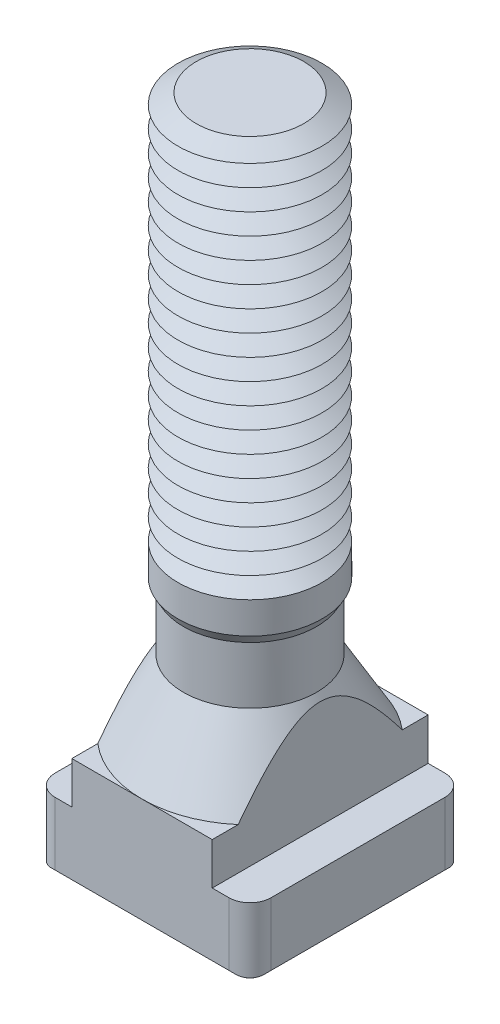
ISO-10303-21;
HEADER;
FILE_DESCRIPTION(('STEP AP214'),'2;1');
FILE_NAME('part.step','',(''),(''),'','','');
FILE_SCHEMA(('AUTOMOTIVE_DESIGN { 1 0 10303 214 1 1 1 1 }'));
ENDSEC;
DATA;
#1=APPLICATION_CONTEXT('core data for automotive mechanical design processes');
#2=APPLICATION_PROTOCOL_DEFINITION('international standard','automotive_design',2000,#1);
#3=PRODUCT_CONTEXT('',#1,'mechanical');
#4=PRODUCT('Part','Part','',(#3));
#5=PRODUCT_RELATED_PRODUCT_CATEGORY('part','',(#4));
#6=PRODUCT_DEFINITION_FORMATION('','',#4);
#7=PRODUCT_DEFINITION_CONTEXT('part definition',#1,'design');
#8=PRODUCT_DEFINITION('design','',#6,#7);
#9=PRODUCT_DEFINITION_SHAPE('','',#8);
#10=(LENGTH_UNIT() NAMED_UNIT(*) SI_UNIT(.MILLI.,.METRE.));
#11=(NAMED_UNIT(*) PLANE_ANGLE_UNIT() SI_UNIT($,.RADIAN.));
#12=(NAMED_UNIT(*) SI_UNIT($,.STERADIAN.) SOLID_ANGLE_UNIT());
#13=UNCERTAINTY_MEASURE_WITH_UNIT(LENGTH_MEASURE(1.E-05),#10,'distance_accuracy_value','');
#14=(GEOMETRIC_REPRESENTATION_CONTEXT(3) GLOBAL_UNCERTAINTY_ASSIGNED_CONTEXT((#13)) GLOBAL_UNIT_ASSIGNED_CONTEXT((#10,
#11,#12)) REPRESENTATION_CONTEXT('',''));
#15=CARTESIAN_POINT('',(0.,0.,0.));
#16=DIRECTION('',(0.,0.,1.));
#17=DIRECTION('',(1.,0.,0.));
#18=AXIS2_PLACEMENT_3D('',#15,#16,#17);
#19=CARTESIAN_POINT('',(0.,50.,0.));
#20=DIRECTION('',(0.,-1.,0.));
#21=DIRECTION('',(0.,0.,-1.));
#22=AXIS2_PLACEMENT_3D('',#19,#20,#21);
#23=CONICAL_SURFACE('',#22,4.48445554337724,1.0471975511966);
#24=CARTESIAN_POINT('',(0.,49.125,0.));
#25=DIRECTION('',(0.,-1.,0.));
#26=DIRECTION('',(0.,0.,-1.));
#27=AXIS2_PLACEMENT_3D('',#24,#25,#26);
#28=CIRCLE('',#27,6.00000000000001);
#29=CARTESIAN_POINT('',(0.,49.125,-6.00000000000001));
#30=VERTEX_POINT('',#29);
#31=EDGE_CURVE('E649',#30,#30,#28,.T.);
#32=ORIENTED_EDGE('',*,*,#31,.F.);
#33=EDGE_LOOP('',(#32));
#34=FACE_BOUND('',#33,.T.);
#35=CARTESIAN_POINT('',(0.,50.,0.));
#36=DIRECTION('',(0.,-1.,0.));
#37=DIRECTION('',(0.,0.,-1.));
#38=AXIS2_PLACEMENT_3D('',#35,#36,#37);
#39=CIRCLE('',#38,4.48445554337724);
#40=CARTESIAN_POINT('',(0.,50.,-4.48445554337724));
#41=VERTEX_POINT('',#40);
#42=EDGE_CURVE('E657',#41,#41,#39,.T.);
#43=ORIENTED_EDGE('',*,*,#42,.T.);
#44=EDGE_LOOP('',(#43));
#45=FACE_BOUND('',#44,.T.);
#46=ADVANCED_FACE('F39',(#34,#45),#23,.T.);
#47=CARTESIAN_POINT('',(0.,50.875,0.));
#48=DIRECTION('',(0.,1.,0.));
#49=DIRECTION('',(0.,0.,1.));
#50=AXIS2_PLACEMENT_3D('',#47,#48,#49);
#51=CONICAL_SURFACE('',#50,6.00000000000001,1.0471975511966);
#52=ORIENTED_EDGE('',*,*,#42,.F.);
#53=EDGE_LOOP('',(#52));
#54=FACE_BOUND('',#53,.T.);
#55=CARTESIAN_POINT('',(0.,50.875,0.));
#56=DIRECTION('',(0.,-1.,0.));
#57=DIRECTION('',(0.,0.,-1.));
#58=AXIS2_PLACEMENT_3D('',#55,#56,#57);
#59=CIRCLE('',#58,6.00000000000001);
#60=CARTESIAN_POINT('',(0.,50.875,-6.00000000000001));
#61=VERTEX_POINT('',#60);
#62=EDGE_CURVE('E655',#61,#61,#59,.T.);
#63=ORIENTED_EDGE('',*,*,#62,.T.);
#64=EDGE_LOOP('',(#63));
#65=FACE_BOUND('',#64,.T.);
#66=ADVANCED_FACE('F448',(#54,#65),#51,.T.);
#67=CARTESIAN_POINT('',(2.9968696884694,57.,0.));
#68=DIRECTION('',(0.,-1.,0.));
#69=DIRECTION('',(1.,0.,0.));
#70=AXIS2_PLACEMENT_3D('',#67,#68,#69);
#71=PLANE('',#70);
#72=CARTESIAN_POINT('',(0.,57.,0.));
#73=DIRECTION('',(0.,-1.,0.));
#74=DIRECTION('',(0.,0.,-1.));
#75=AXIS2_PLACEMENT_3D('',#72,#73,#74);
#76=CIRCLE('',#75,4.48445554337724);
#77=CARTESIAN_POINT('',(0.,57.,-4.48445554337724));
#78=VERTEX_POINT('',#77);
#79=EDGE_CURVE('E679',#78,#78,#76,.T.);
#80=ORIENTED_EDGE('',*,*,#79,.F.);
#81=EDGE_LOOP('',(#80));
#82=FACE_BOUND('',#81,.T.);
#83=ADVANCED_FACE('F454',(#82),#71,.F.);
#84=CARTESIAN_POINT('',(0.,57.,0.));
#85=DIRECTION('',(0.,-1.,0.));
#86=DIRECTION('',(0.,0.,-1.));
#87=AXIS2_PLACEMENT_3D('',#84,#85,#86);
#88=CONICAL_SURFACE('',#87,4.48445554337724,1.0471975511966);
#89=CARTESIAN_POINT('',(0.,56.125,0.));
#90=DIRECTION('',(0.,-1.,0.));
#91=DIRECTION('',(0.,0.,-1.));
#92=AXIS2_PLACEMENT_3D('',#89,#90,#91);
#93=CIRCLE('',#92,6.00000000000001);
#94=CARTESIAN_POINT('',(0.,56.125,-6.00000000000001));
#95=VERTEX_POINT('',#94);
#96=EDGE_CURVE('E760',#95,#95,#93,.T.);
#97=ORIENTED_EDGE('',*,*,#96,.F.);
#98=EDGE_LOOP('',(#97));
#99=FACE_BOUND('',#98,.T.);
#100=ORIENTED_EDGE('',*,*,#79,.T.);
#101=EDGE_LOOP('',(#100));
#102=FACE_BOUND('',#101,.T.);
#103=ADVANCED_FACE('F482',(#99,#102),#88,.T.);
#104=CARTESIAN_POINT('',(0.,56.125,0.));
#105=DIRECTION('',(0.,1.,0.));
#106=DIRECTION('',(0.,0.,1.));
#107=AXIS2_PLACEMENT_3D('',#104,#105,#106);
#108=CONICAL_SURFACE('',#107,6.00000000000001,1.0471975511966);
#109=CARTESIAN_POINT('',(0.,55.25,0.));
#110=DIRECTION('',(0.,-1.,0.));
#111=DIRECTION('',(0.,0.,-1.));
#112=AXIS2_PLACEMENT_3D('',#109,#110,#111);
#113=CIRCLE('',#112,4.48445554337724);
#114=CARTESIAN_POINT('',(0.,55.25,-4.48445554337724));
#115=VERTEX_POINT('',#114);
#116=EDGE_CURVE('E756',#115,#115,#113,.T.);
#117=ORIENTED_EDGE('',*,*,#116,.F.);
#118=EDGE_LOOP('',(#117));
#119=FACE_BOUND('',#118,.T.);
#120=ORIENTED_EDGE('',*,*,#96,.T.);
#121=EDGE_LOOP('',(#120));
#122=FACE_BOUND('',#121,.T.);
#123=ADVANCED_FACE('F479',(#119,#122),#108,.T.);
#124=CARTESIAN_POINT('',(0.,55.25,0.));
#125=DIRECTION('',(0.,-1.,0.));
#126=DIRECTION('',(0.,0.,-1.));
#127=AXIS2_PLACEMENT_3D('',#124,#125,#126);
#128=CONICAL_SURFACE('',#127,4.48445554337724,1.0471975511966);
#129=CARTESIAN_POINT('',(0.,54.375,0.));
#130=DIRECTION('',(0.,-1.,0.));
#131=DIRECTION('',(0.,0.,-1.));
#132=AXIS2_PLACEMENT_3D('',#129,#130,#131);
#133=CIRCLE('',#132,6.00000000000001);
#134=CARTESIAN_POINT('',(0.,54.375,-6.00000000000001));
#135=VERTEX_POINT('',#134);
#136=EDGE_CURVE('E752',#135,#135,#133,.T.);
#137=ORIENTED_EDGE('',*,*,#136,.F.);
#138=EDGE_LOOP('',(#137));
#139=FACE_BOUND('',#138,.T.);
#140=ORIENTED_EDGE('',*,*,#116,.T.);
#141=EDGE_LOOP('',(#140));
#142=FACE_BOUND('',#141,.T.);
#143=ADVANCED_FACE('F474',(#139,#142),#128,.T.);
#144=CARTESIAN_POINT('',(0.,54.375,0.));
#145=DIRECTION('',(0.,1.,0.));
#146=DIRECTION('',(0.,0.,1.));
#147=AXIS2_PLACEMENT_3D('',#144,#145,#146);
#148=CONICAL_SURFACE('',#147,6.00000000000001,1.0471975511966);
#149=CARTESIAN_POINT('',(0.,53.5,0.));
#150=DIRECTION('',(0.,-1.,0.));
#151=DIRECTION('',(0.,0.,-1.));
#152=AXIS2_PLACEMENT_3D('',#149,#150,#151);
#153=CIRCLE('',#152,4.48445554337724);
#154=CARTESIAN_POINT('',(0.,53.5,-4.48445554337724));
#155=VERTEX_POINT('',#154);
#156=EDGE_CURVE('E748',#155,#155,#153,.T.);
#157=ORIENTED_EDGE('',*,*,#156,.F.);
#158=EDGE_LOOP('',(#157));
#159=FACE_BOUND('',#158,.T.);
#160=ORIENTED_EDGE('',*,*,#136,.T.);
#161=EDGE_LOOP('',(#160));
#162=FACE_BOUND('',#161,.T.);
#163=ADVANCED_FACE('F471',(#159,#162),#148,.T.);
#164=CARTESIAN_POINT('',(0.,53.5,0.));
#165=DIRECTION('',(0.,-1.,0.));
#166=DIRECTION('',(0.,0.,-1.));
#167=AXIS2_PLACEMENT_3D('',#164,#165,#166);
#168=CONICAL_SURFACE('',#167,4.48445554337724,1.0471975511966);
#169=CARTESIAN_POINT('',(0.,52.625,0.));
#170=DIRECTION('',(0.,-1.,0.));
#171=DIRECTION('',(0.,0.,-1.));
#172=AXIS2_PLACEMENT_3D('',#169,#170,#171);
#173=CIRCLE('',#172,6.00000000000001);
#174=CARTESIAN_POINT('',(0.,52.625,-6.00000000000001));
#175=VERTEX_POINT('',#174);
#176=EDGE_CURVE('E632',#175,#175,#173,.T.);
#177=ORIENTED_EDGE('',*,*,#176,.F.);
#178=EDGE_LOOP('',(#177));
#179=FACE_BOUND('',#178,.T.);
#180=ORIENTED_EDGE('',*,*,#156,.T.);
#181=EDGE_LOOP('',(#180));
#182=FACE_BOUND('',#181,.T.);
#183=ADVANCED_FACE('F465',(#179,#182),#168,.T.);
#184=CARTESIAN_POINT('',(0.,52.625,0.));
#185=DIRECTION('',(0.,1.,0.));
#186=DIRECTION('',(0.,0.,1.));
#187=AXIS2_PLACEMENT_3D('',#184,#185,#186);
#188=CONICAL_SURFACE('',#187,6.00000000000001,1.0471975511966);
#189=CARTESIAN_POINT('',(0.,51.75,0.));
#190=DIRECTION('',(0.,-1.,0.));
#191=DIRECTION('',(0.,0.,-1.));
#192=AXIS2_PLACEMENT_3D('',#189,#190,#191);
#193=CIRCLE('',#192,4.48445554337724);
#194=CARTESIAN_POINT('',(0.,51.75,-4.48445554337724));
#195=VERTEX_POINT('',#194);
#196=EDGE_CURVE('E652',#195,#195,#193,.T.);
#197=ORIENTED_EDGE('',*,*,#196,.F.);
#198=EDGE_LOOP('',(#197));
#199=FACE_BOUND('',#198,.T.);
#200=ORIENTED_EDGE('',*,*,#176,.T.);
#201=EDGE_LOOP('',(#200));
#202=FACE_BOUND('',#201,.T.);
#203=ADVANCED_FACE('F461',(#199,#202),#188,.T.);
#204=CARTESIAN_POINT('',(0.,51.75,0.));
#205=DIRECTION('',(0.,-1.,0.));
#206=DIRECTION('',(0.,0.,-1.));
#207=AXIS2_PLACEMENT_3D('',#204,#205,#206);
#208=CONICAL_SURFACE('',#207,4.48445554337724,1.0471975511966);
#209=ORIENTED_EDGE('',*,*,#62,.F.);
#210=EDGE_LOOP('',(#209));
#211=FACE_BOUND('',#210,.T.);
#212=ORIENTED_EDGE('',*,*,#196,.T.);
#213=EDGE_LOOP('',(#212));
#214=FACE_BOUND('',#213,.T.);
#215=ADVANCED_FACE('F464',(#211,#214),#208,.T.);
#216=CARTESIAN_POINT('',(0.,48.25,0.));
#217=DIRECTION('',(0.,-1.,0.));
#218=DIRECTION('',(0.,0.,-1.));
#219=AXIS2_PLACEMENT_3D('',#216,#217,#218);
#220=CONICAL_SURFACE('',#219,4.48445554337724,1.0471975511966);
#221=CARTESIAN_POINT('',(0.,47.375,0.));
#222=DIRECTION('',(0.,-1.,0.));
#223=DIRECTION('',(0.,0.,-1.));
#224=AXIS2_PLACEMENT_3D('',#221,#222,#223);
#225=CIRCLE('',#224,6.00000000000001);
#226=CARTESIAN_POINT('',(0.,47.375,-6.00000000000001));
#227=VERTEX_POINT('',#226);
#228=EDGE_CURVE('E650',#227,#227,#225,.T.);
#229=ORIENTED_EDGE('',*,*,#228,.F.);
#230=EDGE_LOOP('',(#229));
#231=FACE_BOUND('',#230,.T.);
#232=CARTESIAN_POINT('',(0.,48.25,0.));
#233=DIRECTION('',(0.,-1.,0.));
#234=DIRECTION('',(0.,0.,-1.));
#235=AXIS2_PLACEMENT_3D('',#232,#233,#234);
#236=CIRCLE('',#235,4.48445554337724);
#237=CARTESIAN_POINT('',(0.,48.25,-4.48445554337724));
#238=VERTEX_POINT('',#237);
#239=EDGE_CURVE('E646',#238,#238,#236,.T.);
#240=ORIENTED_EDGE('',*,*,#239,.T.);
#241=EDGE_LOOP('',(#240));
#242=FACE_BOUND('',#241,.T.);
#243=ADVANCED_FACE('F469',(#231,#242),#220,.T.);
#244=CARTESIAN_POINT('',(0.,49.125,0.));
#245=DIRECTION('',(0.,1.,0.));
#246=DIRECTION('',(0.,0.,1.));
#247=AXIS2_PLACEMENT_3D('',#244,#245,#246);
#248=CONICAL_SURFACE('',#247,6.00000000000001,1.0471975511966);
#249=ORIENTED_EDGE('',*,*,#239,.F.);
#250=EDGE_LOOP('',(#249));
#251=FACE_BOUND('',#250,.T.);
#252=ORIENTED_EDGE('',*,*,#31,.T.);
#253=EDGE_LOOP('',(#252));
#254=FACE_BOUND('',#253,.T.);
#255=ADVANCED_FACE('F875',(#251,#254),#248,.T.);
#256=CARTESIAN_POINT('',(0.,46.5,0.));
#257=DIRECTION('',(0.,-1.,0.));
#258=DIRECTION('',(0.,0.,-1.));
#259=AXIS2_PLACEMENT_3D('',#256,#257,#258);
#260=CONICAL_SURFACE('',#259,4.48445554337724,1.0471975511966);
#261=CARTESIAN_POINT('',(0.,45.625,0.));
#262=DIRECTION('',(0.,-1.,0.));
#263=DIRECTION('',(0.,0.,-1.));
#264=AXIS2_PLACEMENT_3D('',#261,#262,#263);
#265=CIRCLE('',#264,6.00000000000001);
#266=CARTESIAN_POINT('',(0.,45.625,-6.00000000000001));
#267=VERTEX_POINT('',#266);
#268=EDGE_CURVE('E670',#267,#267,#265,.T.);
#269=ORIENTED_EDGE('',*,*,#268,.F.);
#270=EDGE_LOOP('',(#269));
#271=FACE_BOUND('',#270,.T.);
#272=CARTESIAN_POINT('',(0.,46.5,0.));
#273=DIRECTION('',(0.,-1.,0.));
#274=DIRECTION('',(0.,0.,-1.));
#275=AXIS2_PLACEMENT_3D('',#272,#273,#274);
#276=CIRCLE('',#275,4.48445554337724);
#277=CARTESIAN_POINT('',(0.,46.5,-4.48445554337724));
#278=VERTEX_POINT('',#277);
#279=EDGE_CURVE('E737',#278,#278,#276,.T.);
#280=ORIENTED_EDGE('',*,*,#279,.T.);
#281=EDGE_LOOP('',(#280));
#282=FACE_BOUND('',#281,.T.);
#283=ADVANCED_FACE('F871',(#271,#282),#260,.T.);
#284=CARTESIAN_POINT('',(0.,47.375,0.));
#285=DIRECTION('',(0.,1.,0.));
#286=DIRECTION('',(0.,0.,1.));
#287=AXIS2_PLACEMENT_3D('',#284,#285,#286);
#288=CONICAL_SURFACE('',#287,6.00000000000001,1.0471975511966);
#289=ORIENTED_EDGE('',*,*,#279,.F.);
#290=EDGE_LOOP('',(#289));
#291=FACE_BOUND('',#290,.T.);
#292=ORIENTED_EDGE('',*,*,#228,.T.);
#293=EDGE_LOOP('',(#292));
#294=FACE_BOUND('',#293,.T.);
#295=ADVANCED_FACE('F867',(#291,#294),#288,.T.);
#296=CARTESIAN_POINT('',(0.,44.75,0.));
#297=DIRECTION('',(0.,-1.,0.));
#298=DIRECTION('',(0.,0.,-1.));
#299=AXIS2_PLACEMENT_3D('',#296,#297,#298);
#300=CONICAL_SURFACE('',#299,4.48445554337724,1.0471975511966);
#301=CARTESIAN_POINT('',(0.,43.875,0.));
#302=DIRECTION('',(0.,-1.,0.));
#303=DIRECTION('',(0.,0.,-1.));
#304=AXIS2_PLACEMENT_3D('',#301,#302,#303);
#305=CIRCLE('',#304,6.00000000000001);
#306=CARTESIAN_POINT('',(0.,43.875,-6.00000000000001));
#307=VERTEX_POINT('',#306);
#308=EDGE_CURVE('E671',#307,#307,#305,.T.);
#309=ORIENTED_EDGE('',*,*,#308,.F.);
#310=EDGE_LOOP('',(#309));
#311=FACE_BOUND('',#310,.T.);
#312=CARTESIAN_POINT('',(0.,44.75,0.));
#313=DIRECTION('',(0.,-1.,0.));
#314=DIRECTION('',(0.,0.,-1.));
#315=AXIS2_PLACEMENT_3D('',#312,#313,#314);
#316=CIRCLE('',#315,4.48445554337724);
#317=CARTESIAN_POINT('',(0.,44.75,-4.48445554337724));
#318=VERTEX_POINT('',#317);
#319=EDGE_CURVE('E667',#318,#318,#316,.T.);
#320=ORIENTED_EDGE('',*,*,#319,.T.);
#321=EDGE_LOOP('',(#320));
#322=FACE_BOUND('',#321,.T.);
#323=ADVANCED_FACE('F863',(#311,#322),#300,.T.);
#324=CARTESIAN_POINT('',(0.,45.625,0.));
#325=DIRECTION('',(0.,1.,0.));
#326=DIRECTION('',(0.,0.,1.));
#327=AXIS2_PLACEMENT_3D('',#324,#325,#326);
#328=CONICAL_SURFACE('',#327,6.00000000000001,1.0471975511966);
#329=ORIENTED_EDGE('',*,*,#319,.F.);
#330=EDGE_LOOP('',(#329));
#331=FACE_BOUND('',#330,.T.);
#332=ORIENTED_EDGE('',*,*,#268,.T.);
#333=EDGE_LOOP('',(#332));
#334=FACE_BOUND('',#333,.T.);
#335=ADVANCED_FACE('F859',(#331,#334),#328,.T.);
#336=CARTESIAN_POINT('',(0.,43.,0.));
#337=DIRECTION('',(0.,-1.,0.));
#338=DIRECTION('',(0.,0.,-1.));
#339=AXIS2_PLACEMENT_3D('',#336,#337,#338);
#340=CONICAL_SURFACE('',#339,4.48445554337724,1.0471975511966);
#341=CARTESIAN_POINT('',(0.,42.125,0.));
#342=DIRECTION('',(0.,-1.,0.));
#343=DIRECTION('',(0.,0.,-1.));
#344=AXIS2_PLACEMENT_3D('',#341,#342,#343);
#345=CIRCLE('',#344,6.00000000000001);
#346=CARTESIAN_POINT('',(0.,42.125,-6.00000000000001));
#347=VERTEX_POINT('',#346);
#348=EDGE_CURVE('E723',#347,#347,#345,.T.);
#349=ORIENTED_EDGE('',*,*,#348,.F.);
#350=EDGE_LOOP('',(#349));
#351=FACE_BOUND('',#350,.T.);
#352=CARTESIAN_POINT('',(0.,43.,0.));
#353=DIRECTION('',(0.,-1.,0.));
#354=DIRECTION('',(0.,0.,-1.));
#355=AXIS2_PLACEMENT_3D('',#352,#353,#354);
#356=CIRCLE('',#355,4.48445554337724);
#357=CARTESIAN_POINT('',(0.,43.,-4.48445554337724));
#358=VERTEX_POINT('',#357);
#359=EDGE_CURVE('E727',#358,#358,#356,.T.);
#360=ORIENTED_EDGE('',*,*,#359,.T.);
#361=EDGE_LOOP('',(#360));
#362=FACE_BOUND('',#361,.T.);
#363=ADVANCED_FACE('F855',(#351,#362),#340,.T.);
#364=CARTESIAN_POINT('',(0.,43.875,0.));
#365=DIRECTION('',(0.,1.,0.));
#366=DIRECTION('',(0.,0.,1.));
#367=AXIS2_PLACEMENT_3D('',#364,#365,#366);
#368=CONICAL_SURFACE('',#367,6.00000000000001,1.0471975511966);
#369=ORIENTED_EDGE('',*,*,#359,.F.);
#370=EDGE_LOOP('',(#369));
#371=FACE_BOUND('',#370,.T.);
#372=ORIENTED_EDGE('',*,*,#308,.T.);
#373=EDGE_LOOP('',(#372));
#374=FACE_BOUND('',#373,.T.);
#375=ADVANCED_FACE('F851',(#371,#374),#368,.T.);
#376=CARTESIAN_POINT('',(0.,41.25,0.));
#377=DIRECTION('',(0.,-1.,0.));
#378=DIRECTION('',(0.,0.,-1.));
#379=AXIS2_PLACEMENT_3D('',#376,#377,#378);
#380=CONICAL_SURFACE('',#379,4.48445554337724,1.0471975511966);
#381=CARTESIAN_POINT('',(0.,40.375,0.));
#382=DIRECTION('',(0.,-1.,0.));
#383=DIRECTION('',(0.,0.,-1.));
#384=AXIS2_PLACEMENT_3D('',#381,#382,#383);
#385=CIRCLE('',#384,6.00000000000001);
#386=CARTESIAN_POINT('',(0.,40.375,-6.00000000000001));
#387=VERTEX_POINT('',#386);
#388=EDGE_CURVE('E715',#387,#387,#385,.T.);
#389=ORIENTED_EDGE('',*,*,#388,.F.);
#390=EDGE_LOOP('',(#389));
#391=FACE_BOUND('',#390,.T.);
#392=CARTESIAN_POINT('',(0.,41.25,0.));
#393=DIRECTION('',(0.,-1.,0.));
#394=DIRECTION('',(0.,0.,-1.));
#395=AXIS2_PLACEMENT_3D('',#392,#393,#394);
#396=CIRCLE('',#395,4.48445554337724);
#397=CARTESIAN_POINT('',(0.,41.25,-4.48445554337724));
#398=VERTEX_POINT('',#397);
#399=EDGE_CURVE('E719',#398,#398,#396,.T.);
#400=ORIENTED_EDGE('',*,*,#399,.T.);
#401=EDGE_LOOP('',(#400));
#402=FACE_BOUND('',#401,.T.);
#403=ADVANCED_FACE('F847',(#391,#402),#380,.T.);
#404=CARTESIAN_POINT('',(0.,42.125,0.));
#405=DIRECTION('',(0.,1.,0.));
#406=DIRECTION('',(0.,0.,1.));
#407=AXIS2_PLACEMENT_3D('',#404,#405,#406);
#408=CONICAL_SURFACE('',#407,6.00000000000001,1.0471975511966);
#409=ORIENTED_EDGE('',*,*,#399,.F.);
#410=EDGE_LOOP('',(#409));
#411=FACE_BOUND('',#410,.T.);
#412=ORIENTED_EDGE('',*,*,#348,.T.);
#413=EDGE_LOOP('',(#412));
#414=FACE_BOUND('',#413,.T.);
#415=ADVANCED_FACE('F843',(#411,#414),#408,.T.);
#416=CARTESIAN_POINT('',(0.,39.5,0.));
#417=DIRECTION('',(0.,-1.,0.));
#418=DIRECTION('',(0.,0.,-1.));
#419=AXIS2_PLACEMENT_3D('',#416,#417,#418);
#420=CONICAL_SURFACE('',#419,4.48445554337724,1.0471975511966);
#421=CARTESIAN_POINT('',(0.,38.625,0.));
#422=DIRECTION('',(0.,-1.,0.));
#423=DIRECTION('',(0.,0.,-1.));
#424=AXIS2_PLACEMENT_3D('',#421,#422,#423);
#425=CIRCLE('',#424,6.00000000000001);
#426=CARTESIAN_POINT('',(0.,38.625,-6.00000000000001));
#427=VERTEX_POINT('',#426);
#428=EDGE_CURVE('E643',#427,#427,#425,.T.);
#429=ORIENTED_EDGE('',*,*,#428,.F.);
#430=EDGE_LOOP('',(#429));
#431=FACE_BOUND('',#430,.T.);
#432=CARTESIAN_POINT('',(0.,39.5,0.));
#433=DIRECTION('',(0.,-1.,0.));
#434=DIRECTION('',(0.,0.,-1.));
#435=AXIS2_PLACEMENT_3D('',#432,#433,#434);
#436=CIRCLE('',#435,4.48445554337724);
#437=CARTESIAN_POINT('',(0.,39.5,-4.48445554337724));
#438=VERTEX_POINT('',#437);
#439=EDGE_CURVE('E711',#438,#438,#436,.T.);
#440=ORIENTED_EDGE('',*,*,#439,.T.);
#441=EDGE_LOOP('',(#440));
#442=FACE_BOUND('',#441,.T.);
#443=ADVANCED_FACE('F839',(#431,#442),#420,.T.);
#444=CARTESIAN_POINT('',(0.,40.375,0.));
#445=DIRECTION('',(0.,1.,0.));
#446=DIRECTION('',(0.,0.,1.));
#447=AXIS2_PLACEMENT_3D('',#444,#445,#446);
#448=CONICAL_SURFACE('',#447,6.00000000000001,1.0471975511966);
#449=ORIENTED_EDGE('',*,*,#439,.F.);
#450=EDGE_LOOP('',(#449));
#451=FACE_BOUND('',#450,.T.);
#452=ORIENTED_EDGE('',*,*,#388,.T.);
#453=EDGE_LOOP('',(#452));
#454=FACE_BOUND('',#453,.T.);
#455=ADVANCED_FACE('F835',(#451,#454),#448,.T.);
#456=CARTESIAN_POINT('',(0.,37.75,0.));
#457=DIRECTION('',(0.,-1.,0.));
#458=DIRECTION('',(0.,0.,-1.));
#459=AXIS2_PLACEMENT_3D('',#456,#457,#458);
#460=CONICAL_SURFACE('',#459,4.48445554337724,1.0471975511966);
#461=CARTESIAN_POINT('',(0.,36.875,0.));
#462=DIRECTION('',(0.,-1.,0.));
#463=DIRECTION('',(0.,0.,-1.));
#464=AXIS2_PLACEMENT_3D('',#461,#462,#463);
#465=CIRCLE('',#464,6.00000000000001);
#466=CARTESIAN_POINT('',(0.,36.875,-6.00000000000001));
#467=VERTEX_POINT('',#466);
#468=EDGE_CURVE('E644',#467,#467,#465,.T.);
#469=ORIENTED_EDGE('',*,*,#468,.F.);
#470=EDGE_LOOP('',(#469));
#471=FACE_BOUND('',#470,.T.);
#472=CARTESIAN_POINT('',(0.,37.75,0.));
#473=DIRECTION('',(0.,-1.,0.));
#474=DIRECTION('',(0.,0.,-1.));
#475=AXIS2_PLACEMENT_3D('',#472,#473,#474);
#476=CIRCLE('',#475,4.48445554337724);
#477=CARTESIAN_POINT('',(0.,37.75,-4.48445554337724));
#478=VERTEX_POINT('',#477);
#479=EDGE_CURVE('E640',#478,#478,#476,.T.);
#480=ORIENTED_EDGE('',*,*,#479,.T.);
#481=EDGE_LOOP('',(#480));
#482=FACE_BOUND('',#481,.T.);
#483=ADVANCED_FACE('F831',(#471,#482),#460,.T.);
#484=CARTESIAN_POINT('',(0.,38.625,0.));
#485=DIRECTION('',(0.,1.,0.));
#486=DIRECTION('',(0.,0.,1.));
#487=AXIS2_PLACEMENT_3D('',#484,#485,#486);
#488=CONICAL_SURFACE('',#487,6.00000000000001,1.0471975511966);
#489=ORIENTED_EDGE('',*,*,#479,.F.);
#490=EDGE_LOOP('',(#489));
#491=FACE_BOUND('',#490,.T.);
#492=ORIENTED_EDGE('',*,*,#428,.T.);
#493=EDGE_LOOP('',(#492));
#494=FACE_BOUND('',#493,.T.);
#495=ADVANCED_FACE('F827',(#491,#494),#488,.T.);
#496=CARTESIAN_POINT('',(0.,36.,0.));
#497=DIRECTION('',(0.,-1.,0.));
#498=DIRECTION('',(0.,0.,-1.));
#499=AXIS2_PLACEMENT_3D('',#496,#497,#498);
#500=CONICAL_SURFACE('',#499,4.48445554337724,1.0471975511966);
#501=CARTESIAN_POINT('',(0.,35.125,0.));
#502=DIRECTION('',(0.,-1.,0.));
#503=DIRECTION('',(0.,0.,-1.));
#504=AXIS2_PLACEMENT_3D('',#501,#502,#503);
#505=CIRCLE('',#504,6.00000000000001);
#506=CARTESIAN_POINT('',(0.,35.125,-6.00000000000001));
#507=VERTEX_POINT('',#506);
#508=EDGE_CURVE('E691',#507,#507,#505,.T.);
#509=ORIENTED_EDGE('',*,*,#508,.F.);
#510=EDGE_LOOP('',(#509));
#511=FACE_BOUND('',#510,.T.);
#512=CARTESIAN_POINT('',(0.,36.,0.));
#513=DIRECTION('',(0.,-1.,0.));
#514=DIRECTION('',(0.,0.,-1.));
#515=AXIS2_PLACEMENT_3D('',#512,#513,#514);
#516=CIRCLE('',#515,4.48445554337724);
#517=CARTESIAN_POINT('',(0.,36.,-4.48445554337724));
#518=VERTEX_POINT('',#517);
#519=EDGE_CURVE('E701',#518,#518,#516,.T.);
#520=ORIENTED_EDGE('',*,*,#519,.T.);
#521=EDGE_LOOP('',(#520));
#522=FACE_BOUND('',#521,.T.);
#523=ADVANCED_FACE('F823',(#511,#522),#500,.T.);
#524=CARTESIAN_POINT('',(0.,36.875,0.));
#525=DIRECTION('',(0.,1.,0.));
#526=DIRECTION('',(0.,0.,1.));
#527=AXIS2_PLACEMENT_3D('',#524,#525,#526);
#528=CONICAL_SURFACE('',#527,6.00000000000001,1.0471975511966);
#529=ORIENTED_EDGE('',*,*,#519,.F.);
#530=EDGE_LOOP('',(#529));
#531=FACE_BOUND('',#530,.T.);
#532=ORIENTED_EDGE('',*,*,#468,.T.);
#533=EDGE_LOOP('',(#532));
#534=FACE_BOUND('',#533,.T.);
#535=ADVANCED_FACE('F819',(#531,#534),#528,.T.);
#536=CARTESIAN_POINT('',(0.,34.25,0.));
#537=DIRECTION('',(0.,-1.,0.));
#538=DIRECTION('',(0.,0.,-1.));
#539=AXIS2_PLACEMENT_3D('',#536,#537,#538);
#540=CONICAL_SURFACE('',#539,4.48445554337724,1.0471975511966);
#541=CARTESIAN_POINT('',(0.,33.375,0.));
#542=DIRECTION('',(0.,-1.,0.));
#543=DIRECTION('',(0.,0.,-1.));
#544=AXIS2_PLACEMENT_3D('',#541,#542,#543);
#545=CIRCLE('',#544,6.00000000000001);
#546=CARTESIAN_POINT('',(0.,33.375,-6.00000000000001));
#547=VERTEX_POINT('',#546);
#548=EDGE_CURVE('E682',#547,#547,#545,.T.);
#549=ORIENTED_EDGE('',*,*,#548,.F.);
#550=EDGE_LOOP('',(#549));
#551=FACE_BOUND('',#550,.T.);
#552=CARTESIAN_POINT('',(0.,34.25,0.));
#553=DIRECTION('',(0.,-1.,0.));
#554=DIRECTION('',(0.,0.,-1.));
#555=AXIS2_PLACEMENT_3D('',#552,#553,#554);
#556=CIRCLE('',#555,4.48445554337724);
#557=CARTESIAN_POINT('',(0.,34.25,-4.48445554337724));
#558=VERTEX_POINT('',#557);
#559=EDGE_CURVE('E684',#558,#558,#556,.T.);
#560=ORIENTED_EDGE('',*,*,#559,.T.);
#561=EDGE_LOOP('',(#560));
#562=FACE_BOUND('',#561,.T.);
#563=ADVANCED_FACE('F815',(#551,#562),#540,.T.);
#564=CARTESIAN_POINT('',(0.,35.125,0.));
#565=DIRECTION('',(0.,1.,0.));
#566=DIRECTION('',(0.,0.,1.));
#567=AXIS2_PLACEMENT_3D('',#564,#565,#566);
#568=CONICAL_SURFACE('',#567,6.00000000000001,1.0471975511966);
#569=ORIENTED_EDGE('',*,*,#559,.F.);
#570=EDGE_LOOP('',(#569));
#571=FACE_BOUND('',#570,.T.);
#572=ORIENTED_EDGE('',*,*,#508,.T.);
#573=EDGE_LOOP('',(#572));
#574=FACE_BOUND('',#573,.T.);
#575=ADVANCED_FACE('F799',(#571,#574),#568,.T.);
#576=CARTESIAN_POINT('',(0.,32.5,0.));
#577=DIRECTION('',(0.,-1.,0.));
#578=DIRECTION('',(0.,0.,-1.));
#579=AXIS2_PLACEMENT_3D('',#576,#577,#578);
#580=CONICAL_SURFACE('',#579,4.48445554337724,1.0471975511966);
#581=CARTESIAN_POINT('',(0.,31.625,0.));
#582=DIRECTION('',(0.,-1.,0.));
#583=DIRECTION('',(0.,0.,-1.));
#584=AXIS2_PLACEMENT_3D('',#581,#582,#583);
#585=CIRCLE('',#584,6.00000000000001);
#586=CARTESIAN_POINT('',(0.,31.625,-6.00000000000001));
#587=VERTEX_POINT('',#586);
#588=EDGE_CURVE('E637',#587,#587,#585,.T.);
#589=ORIENTED_EDGE('',*,*,#588,.F.);
#590=EDGE_LOOP('',(#589));
#591=FACE_BOUND('',#590,.T.);
#592=CARTESIAN_POINT('',(0.,32.5,0.));
#593=DIRECTION('',(0.,-1.,0.));
#594=DIRECTION('',(0.,0.,-1.));
#595=AXIS2_PLACEMENT_3D('',#592,#593,#594);
#596=CIRCLE('',#595,4.48445554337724);
#597=CARTESIAN_POINT('',(0.,32.5,-4.48445554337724));
#598=VERTEX_POINT('',#597);
#599=EDGE_CURVE('E685',#598,#598,#596,.T.);
#600=ORIENTED_EDGE('',*,*,#599,.T.);
#601=EDGE_LOOP('',(#600));
#602=FACE_BOUND('',#601,.T.);
#603=ADVANCED_FACE('F795',(#591,#602),#580,.T.);
#604=CARTESIAN_POINT('',(0.,33.375,0.));
#605=DIRECTION('',(0.,1.,0.));
#606=DIRECTION('',(0.,0.,1.));
#607=AXIS2_PLACEMENT_3D('',#604,#605,#606);
#608=CONICAL_SURFACE('',#607,6.00000000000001,1.0471975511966);
#609=ORIENTED_EDGE('',*,*,#599,.F.);
#610=EDGE_LOOP('',(#609));
#611=FACE_BOUND('',#610,.T.);
#612=ORIENTED_EDGE('',*,*,#548,.T.);
#613=EDGE_LOOP('',(#612));
#614=FACE_BOUND('',#613,.T.);
#615=ADVANCED_FACE('F798',(#611,#614),#608,.T.);
#616=CARTESIAN_POINT('',(0.,30.75,0.));
#617=DIRECTION('',(0.,-1.,0.));
#618=DIRECTION('',(0.,0.,-1.));
#619=AXIS2_PLACEMENT_3D('',#616,#617,#618);
#620=CONICAL_SURFACE('',#619,4.48445554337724,1.0471975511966);
#621=CARTESIAN_POINT('',(0.,29.875,0.));
#622=DIRECTION('',(0.,-1.,0.));
#623=DIRECTION('',(0.,0.,-1.));
#624=AXIS2_PLACEMENT_3D('',#621,#622,#623);
#625=CIRCLE('',#624,6.00000000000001);
#626=CARTESIAN_POINT('',(0.,29.875,-6.00000000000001));
#627=VERTEX_POINT('',#626);
#628=EDGE_CURVE('E638',#627,#627,#625,.T.);
#629=ORIENTED_EDGE('',*,*,#628,.F.);
#630=EDGE_LOOP('',(#629));
#631=FACE_BOUND('',#630,.T.);
#632=CARTESIAN_POINT('',(0.,30.75,0.));
#633=DIRECTION('',(0.,-1.,0.));
#634=DIRECTION('',(0.,0.,-1.));
#635=AXIS2_PLACEMENT_3D('',#632,#633,#634);
#636=CIRCLE('',#635,4.48445554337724);
#637=CARTESIAN_POINT('',(0.,30.75,-4.48445554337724));
#638=VERTEX_POINT('',#637);
#639=EDGE_CURVE('E634',#638,#638,#636,.T.);
#640=ORIENTED_EDGE('',*,*,#639,.T.);
#641=EDGE_LOOP('',(#640));
#642=FACE_BOUND('',#641,.T.);
#643=ADVANCED_FACE('F804',(#631,#642),#620,.T.);
#644=CARTESIAN_POINT('',(0.,31.625,0.));
#645=DIRECTION('',(0.,1.,0.));
#646=DIRECTION('',(0.,0.,1.));
#647=AXIS2_PLACEMENT_3D('',#644,#645,#646);
#648=CONICAL_SURFACE('',#647,6.00000000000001,1.0471975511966);
#649=ORIENTED_EDGE('',*,*,#639,.F.);
#650=EDGE_LOOP('',(#649));
#651=FACE_BOUND('',#650,.T.);
#652=ORIENTED_EDGE('',*,*,#588,.T.);
#653=EDGE_LOOP('',(#652));
#654=FACE_BOUND('',#653,.T.);
#655=ADVANCED_FACE('F793',(#651,#654),#648,.T.);
#656=CARTESIAN_POINT('',(0.,29.,0.));
#657=DIRECTION('',(0.,-1.,0.));
#658=DIRECTION('',(0.,0.,-1.));
#659=AXIS2_PLACEMENT_3D('',#656,#657,#658);
#660=CONICAL_SURFACE('',#659,4.48445554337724,1.0471975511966);
#661=CARTESIAN_POINT('',(0.,28.125,0.));
#662=DIRECTION('',(0.,-1.,0.));
#663=DIRECTION('',(0.,0.,-1.));
#664=AXIS2_PLACEMENT_3D('',#661,#662,#663);
#665=CIRCLE('',#664,6.00000000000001);
#666=CARTESIAN_POINT('',(0.,28.125,-6.00000000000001));
#667=VERTEX_POINT('',#666);
#668=EDGE_CURVE('E786',#667,#667,#665,.T.);
#669=ORIENTED_EDGE('',*,*,#668,.F.);
#670=EDGE_LOOP('',(#669));
#671=FACE_BOUND('',#670,.T.);
#672=CARTESIAN_POINT('',(0.,29.,0.));
#673=DIRECTION('',(0.,-1.,0.));
#674=DIRECTION('',(0.,0.,-1.));
#675=AXIS2_PLACEMENT_3D('',#672,#673,#674);
#676=CIRCLE('',#675,4.48445554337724);
#677=CARTESIAN_POINT('',(0.,29.,-4.48445554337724));
#678=VERTEX_POINT('',#677);
#679=EDGE_CURVE('E780',#678,#678,#676,.T.);
#680=ORIENTED_EDGE('',*,*,#679,.T.);
#681=EDGE_LOOP('',(#680));
#682=FACE_BOUND('',#681,.T.);
#683=ADVANCED_FACE('F959',(#671,#682),#660,.T.);
#684=CARTESIAN_POINT('',(0.,29.875,0.));
#685=DIRECTION('',(0.,1.,0.));
#686=DIRECTION('',(0.,0.,1.));
#687=AXIS2_PLACEMENT_3D('',#684,#685,#686);
#688=CONICAL_SURFACE('',#687,6.00000000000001,1.0471975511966);
#689=ORIENTED_EDGE('',*,*,#679,.F.);
#690=EDGE_LOOP('',(#689));
#691=FACE_BOUND('',#690,.T.);
#692=ORIENTED_EDGE('',*,*,#628,.T.);
#693=EDGE_LOOP('',(#692));
#694=FACE_BOUND('',#693,.T.);
#695=ADVANCED_FACE('F967',(#691,#694),#688,.T.);
#696=CARTESIAN_POINT('',(0.,27.25,0.));
#697=DIRECTION('',(0.,-1.,0.));
#698=DIRECTION('',(0.,0.,-1.));
#699=AXIS2_PLACEMENT_3D('',#696,#697,#698);
#700=CONICAL_SURFACE('',#699,4.48445554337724,1.0471975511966);
#701=CARTESIAN_POINT('',(0.,26.375,0.));
#702=DIRECTION('',(0.,-1.,0.));
#703=DIRECTION('',(0.,0.,-1.));
#704=AXIS2_PLACEMENT_3D('',#701,#702,#703);
#705=CIRCLE('',#704,6.00000000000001);
#706=CARTESIAN_POINT('',(0.,26.375,-6.00000000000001));
#707=VERTEX_POINT('',#706);
#708=EDGE_CURVE('E661',#707,#707,#705,.T.);
#709=ORIENTED_EDGE('',*,*,#708,.F.);
#710=EDGE_LOOP('',(#709));
#711=FACE_BOUND('',#710,.T.);
#712=CARTESIAN_POINT('',(0.,27.25,0.));
#713=DIRECTION('',(0.,-1.,0.));
#714=DIRECTION('',(0.,0.,-1.));
#715=AXIS2_PLACEMENT_3D('',#712,#713,#714);
#716=CIRCLE('',#715,4.48445554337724);
#717=CARTESIAN_POINT('',(0.,27.25,-4.48445554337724));
#718=VERTEX_POINT('',#717);
#719=EDGE_CURVE('E1390',#718,#718,#716,.T.);
#720=ORIENTED_EDGE('',*,*,#719,.T.);
#721=EDGE_LOOP('',(#720));
#722=FACE_BOUND('',#721,.T.);
#723=ADVANCED_FACE('F976',(#711,#722),#700,.T.);
#724=CARTESIAN_POINT('',(0.,28.125,0.));
#725=DIRECTION('',(0.,1.,0.));
#726=DIRECTION('',(0.,0.,1.));
#727=AXIS2_PLACEMENT_3D('',#724,#725,#726);
#728=CONICAL_SURFACE('',#727,6.00000000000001,1.0471975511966);
#729=ORIENTED_EDGE('',*,*,#719,.F.);
#730=EDGE_LOOP('',(#729));
#731=FACE_BOUND('',#730,.T.);
#732=ORIENTED_EDGE('',*,*,#668,.T.);
#733=EDGE_LOOP('',(#732));
#734=FACE_BOUND('',#733,.T.);
#735=ADVANCED_FACE('F985',(#731,#734),#728,.T.);
#736=CARTESIAN_POINT('',(0.,25.5,0.));
#737=DIRECTION('',(0.,-1.,0.));
#738=DIRECTION('',(0.,0.,-1.));
#739=AXIS2_PLACEMENT_3D('',#736,#737,#738);
#740=CONICAL_SURFACE('',#739,4.48445554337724,1.0471975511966);
#741=CARTESIAN_POINT('',(0.,24.625,0.));
#742=DIRECTION('',(0.,-1.,0.));
#743=DIRECTION('',(0.,0.,-1.));
#744=AXIS2_PLACEMENT_3D('',#741,#742,#743);
#745=CIRCLE('',#744,6.00000000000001);
#746=CARTESIAN_POINT('',(0.,24.625,-6.00000000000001));
#747=VERTEX_POINT('',#746);
#748=EDGE_CURVE('E664',#747,#747,#745,.T.);
#749=ORIENTED_EDGE('',*,*,#748,.F.);
#750=EDGE_LOOP('',(#749));
#751=FACE_BOUND('',#750,.T.);
#752=CARTESIAN_POINT('',(0.,25.5,0.));
#753=DIRECTION('',(0.,-1.,0.));
#754=DIRECTION('',(0.,0.,-1.));
#755=AXIS2_PLACEMENT_3D('',#752,#753,#754);
#756=CIRCLE('',#755,4.48445554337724);
#757=CARTESIAN_POINT('',(0.,25.5,-4.48445554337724));
#758=VERTEX_POINT('',#757);
#759=EDGE_CURVE('E665',#758,#758,#756,.T.);
#760=ORIENTED_EDGE('',*,*,#759,.T.);
#761=EDGE_LOOP('',(#760));
#762=FACE_BOUND('',#761,.T.);
#763=ADVANCED_FACE('F566',(#751,#762),#740,.T.);
#764=CARTESIAN_POINT('',(0.,26.375,0.));
#765=DIRECTION('',(0.,1.,0.));
#766=DIRECTION('',(0.,0.,1.));
#767=AXIS2_PLACEMENT_3D('',#764,#765,#766);
#768=CONICAL_SURFACE('',#767,6.00000000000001,1.0471975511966);
#769=ORIENTED_EDGE('',*,*,#759,.F.);
#770=EDGE_LOOP('',(#769));
#771=FACE_BOUND('',#770,.T.);
#772=ORIENTED_EDGE('',*,*,#708,.T.);
#773=EDGE_LOOP('',(#772));
#774=FACE_BOUND('',#773,.T.);
#775=ADVANCED_FACE('F561',(#771,#774),#768,.T.);
#776=CARTESIAN_POINT('',(-8.17504208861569,3.39991582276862,-8.17504208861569));
#777=DIRECTION('',(-0.577350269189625,0.577350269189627,-0.577350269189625));
#778=DIRECTION('',(0.,0.707106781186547,0.707106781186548));
#779=AXIS2_PLACEMENT_3D('',#776,#777,#778);
#780=CYLINDRICAL_SURFACE('',#779,1.75);
#781=CARTESIAN_POINT('',(-4.77512626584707,0.,-4.77512626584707));
#782=DIRECTION('',(0.,1.,0.));
#783=DIRECTION('',(-0.707106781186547,0.,-0.707106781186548));
#784=AXIS2_PLACEMENT_3D('',#781,#782,#783);
#785=ELLIPSE('',#784,3.03108891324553,1.75);
#786=CARTESIAN_POINT('',(-7.24999999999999,0.,-6.01256313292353));
#787=VERTEX_POINT('',#786);
#788=CARTESIAN_POINT('',(-6.01256313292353,0.,-7.24999999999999));
#789=VERTEX_POINT('',#788);
#790=EDGE_CURVE('E324',#787,#789,#785,.F.);
#791=ORIENTED_EDGE('',*,*,#790,.F.);
#792=DIRECTION('',(0.577350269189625,-0.577350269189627,0.577350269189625));
#793=VECTOR('',#792,1.);
#794=CARTESIAN_POINT('',(-3.41247895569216,-3.83752104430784,-2.1750420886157));
#795=LINE('',#794,#793);
#796=CARTESIAN_POINT('',(-8.94037019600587,1.69037019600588,-7.70293332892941));
#797=VERTEX_POINT('',#796);
#798=EDGE_CURVE('E365',#797,#787,#795,.T.);
#799=ORIENTED_EDGE('',*,*,#798,.F.);
#800=CARTESIAN_POINT('',(-7.25,2.47487373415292,-7.24999999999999));
#801=DIRECTION('',(0.325057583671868,-0.888073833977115,0.325057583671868));
#802=DIRECTION('',(-0.627963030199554,-0.459700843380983,-0.627963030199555));
#803=AXIS2_PLACEMENT_3D('',#800,#801,#802);
#804=ELLIPSE('',#803,1.97055687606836,1.75);
#805=CARTESIAN_POINT('',(-7.7029333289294,1.69037019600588,-8.94037019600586));
#806=VERTEX_POINT('',#805);
#807=EDGE_CURVE('E264',#797,#806,#804,.T.);
#808=ORIENTED_EDGE('',*,*,#807,.T.);
#809=DIRECTION('',(0.577350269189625,-0.577350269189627,0.577350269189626));
#810=VECTOR('',#809,1.);
#811=CARTESIAN_POINT('',(-8.17504208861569,2.16247895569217,-9.41247895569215));
#812=LINE('',#811,#810);
#813=EDGE_CURVE('E358',#789,#806,#812,.F.);
#814=ORIENTED_EDGE('',*,*,#813,.F.);
#815=EDGE_LOOP('',(#791,#799,#808,#814));
#816=FACE_BOUND('',#815,.T.);
#817=ADVANCED_FACE('F550',(#816),#780,.T.);
#818=CARTESIAN_POINT('',(2.1750420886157,-2.60008417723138,-2.1750420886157));
#819=DIRECTION('',(0.577350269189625,0.577350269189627,-0.577350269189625));
#820=DIRECTION('',(-0.707106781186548,0.707106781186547,0.));
#821=AXIS2_PLACEMENT_3D('',#818,#819,#820);
#822=CYLINDRICAL_SURFACE('',#821,1.75);
#823=CARTESIAN_POINT('',(4.77512626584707,0.,-4.77512626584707));
#824=DIRECTION('',(0.,1.,0.));
#825=DIRECTION('',(0.707106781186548,0.,-0.707106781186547));
#826=AXIS2_PLACEMENT_3D('',#823,#824,#825);
#827=ELLIPSE('',#826,3.03108891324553,1.75);
#828=CARTESIAN_POINT('',(6.01256313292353,0.,-7.24999999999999));
#829=VERTEX_POINT('',#828);
#830=CARTESIAN_POINT('',(7.24999999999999,0.,-6.01256313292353));
#831=VERTEX_POINT('',#830);
#832=EDGE_CURVE('E330',#829,#831,#827,.F.);
#833=ORIENTED_EDGE('',*,*,#832,.F.);
#834=DIRECTION('',(-0.577350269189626,-0.577350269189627,0.577350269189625));
#835=VECTOR('',#834,1.);
#836=CARTESIAN_POINT('',(2.1750420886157,-3.83752104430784,-3.41247895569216));
#837=LINE('',#836,#835);
#838=CARTESIAN_POINT('',(7.70293332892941,1.69037019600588,-8.94037019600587));
#839=VERTEX_POINT('',#838);
#840=EDGE_CURVE('E352',#839,#829,#837,.T.);
#841=ORIENTED_EDGE('',*,*,#840,.F.);
#842=CARTESIAN_POINT('',(7.24999999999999,2.47487373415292,-7.25));
#843=DIRECTION('',(-0.325057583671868,-0.888073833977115,0.325057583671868));
#844=DIRECTION('',(0.627963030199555,-0.459700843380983,-0.627963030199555));
#845=AXIS2_PLACEMENT_3D('',#842,#843,#844);
#846=ELLIPSE('',#845,1.97055687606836,1.75);
#847=CARTESIAN_POINT('',(8.94037019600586,1.69037019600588,-7.7029333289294));
#848=VERTEX_POINT('',#847);
#849=EDGE_CURVE('E406',#839,#848,#846,.T.);
#850=ORIENTED_EDGE('',*,*,#849,.T.);
#851=DIRECTION('',(-0.577350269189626,-0.577350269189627,0.577350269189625));
#852=VECTOR('',#851,1.);
#853=CARTESIAN_POINT('',(3.41247895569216,-3.83752104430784,-2.1750420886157));
#854=LINE('',#853,#852);
#855=EDGE_CURVE('E320',#831,#848,#854,.F.);
#856=ORIENTED_EDGE('',*,*,#855,.F.);
#857=EDGE_LOOP('',(#833,#841,#850,#856));
#858=FACE_BOUND('',#857,.T.);
#859=ADVANCED_FACE('F546',(#858),#822,.T.);
#860=CARTESIAN_POINT('',(9.,0.,-9.));
#861=DIRECTION('',(0.,1.,0.));
#862=DIRECTION('',(0.,0.,1.));
#863=AXIS2_PLACEMENT_3D('',#860,#861,#862);
#864=PLANE('',#863);
#865=DIRECTION('',(0.,0.,1.));
#866=VECTOR('',#865,1.);
#867=CARTESIAN_POINT('',(7.24999999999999,0.,-9.));
#868=LINE('',#867,#866);
#869=CARTESIAN_POINT('',(7.24999999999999,0.,6.01256313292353));
#870=VERTEX_POINT('',#869);
#871=EDGE_CURVE('E294',#831,#870,#868,.T.);
#872=ORIENTED_EDGE('',*,*,#871,.T.);
#873=CARTESIAN_POINT('',(4.77512626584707,0.,4.77512626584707));
#874=DIRECTION('',(0.,1.,0.));
#875=DIRECTION('',(-0.707106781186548,0.,-0.707106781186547));
#876=AXIS2_PLACEMENT_3D('',#873,#874,#875);
#877=ELLIPSE('',#876,3.03108891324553,1.75);
#878=CARTESIAN_POINT('',(6.01256313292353,0.,7.24999999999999));
#879=VERTEX_POINT('',#878);
#880=EDGE_CURVE('E333',#870,#879,#877,.F.);
#881=ORIENTED_EDGE('',*,*,#880,.T.);
#882=DIRECTION('',(-1.,0.,0.));
#883=VECTOR('',#882,1.);
#884=CARTESIAN_POINT('',(9.,0.,7.24999999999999));
#885=LINE('',#884,#883);
#886=CARTESIAN_POINT('',(-6.01256313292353,0.,7.24999999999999));
#887=VERTEX_POINT('',#886);
#888=EDGE_CURVE('E281',#879,#887,#885,.T.);
#889=ORIENTED_EDGE('',*,*,#888,.T.);
#890=CARTESIAN_POINT('',(-4.77512626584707,0.,4.77512626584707));
#891=DIRECTION('',(0.,1.,0.));
#892=DIRECTION('',(0.707106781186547,0.,-0.707106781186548));
#893=AXIS2_PLACEMENT_3D('',#890,#891,#892);
#894=ELLIPSE('',#893,3.03108891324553,1.75);
#895=CARTESIAN_POINT('',(-7.24999999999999,0.,6.01256313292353));
#896=VERTEX_POINT('',#895);
#897=EDGE_CURVE('E327',#887,#896,#894,.F.);
#898=ORIENTED_EDGE('',*,*,#897,.T.);
#899=DIRECTION('',(0.,0.,-1.));
#900=VECTOR('',#899,1.);
#901=CARTESIAN_POINT('',(-7.24999999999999,0.,-9.));
#902=LINE('',#901,#900);
#903=EDGE_CURVE('E286',#896,#787,#902,.T.);
#904=ORIENTED_EDGE('',*,*,#903,.T.);
#905=ORIENTED_EDGE('',*,*,#790,.T.);
#906=DIRECTION('',(1.,0.,0.));
#907=VECTOR('',#906,1.);
#908=CARTESIAN_POINT('',(9.,0.,-7.24999999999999));
#909=LINE('',#908,#907);
#910=EDGE_CURVE('E290',#789,#829,#909,.T.);
#911=ORIENTED_EDGE('',*,*,#910,.T.);
#912=ORIENTED_EDGE('',*,*,#832,.T.);
#913=EDGE_LOOP('',(#872,#881,#889,#898,#904,#905,#911,#912));
#914=FACE_BOUND('',#913,.T.);
#915=ADVANCED_FACE('F549',(#914),#864,.F.);
#916=CARTESIAN_POINT('',(-8.17504208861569,3.39991582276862,8.17504208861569));
#917=DIRECTION('',(0.577350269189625,-0.577350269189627,-0.577350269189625));
#918=DIRECTION('',(0.,0.707106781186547,-0.707106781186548));
#919=AXIS2_PLACEMENT_3D('',#916,#917,#918);
#920=CYLINDRICAL_SURFACE('',#919,1.75);
#921=CARTESIAN_POINT('',(-7.25,2.47487373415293,7.25));
#922=DIRECTION('',(0.325057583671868,-0.888073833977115,-0.325057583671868));
#923=DIRECTION('',(-0.627963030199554,-0.459700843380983,0.627963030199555));
#924=AXIS2_PLACEMENT_3D('',#921,#922,#923);
#925=ELLIPSE('',#924,1.97055687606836,1.75);
#926=CARTESIAN_POINT('',(-7.70293332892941,1.69037019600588,8.94037019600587));
#927=VERTEX_POINT('',#926);
#928=CARTESIAN_POINT('',(-8.94037019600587,1.69037019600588,7.70293332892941));
#929=VERTEX_POINT('',#928);
#930=EDGE_CURVE('E409',#927,#929,#925,.T.);
#931=ORIENTED_EDGE('',*,*,#930,.T.);
#932=DIRECTION('',(-0.577350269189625,0.577350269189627,0.577350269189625));
#933=VECTOR('',#932,1.);
#934=CARTESIAN_POINT('',(-9.41247895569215,2.16247895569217,8.17504208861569));
#935=LINE('',#934,#933);
#936=EDGE_CURVE('E371',#896,#929,#935,.T.);
#937=ORIENTED_EDGE('',*,*,#936,.F.);
#938=ORIENTED_EDGE('',*,*,#897,.F.);
#939=DIRECTION('',(-0.577350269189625,0.577350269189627,0.577350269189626));
#940=VECTOR('',#939,1.);
#941=CARTESIAN_POINT('',(-8.17504208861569,2.16247895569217,9.41247895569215));
#942=LINE('',#941,#940);
#943=EDGE_CURVE('E345',#927,#887,#942,.F.);
#944=ORIENTED_EDGE('',*,*,#943,.F.);
#945=EDGE_LOOP('',(#931,#937,#938,#944));
#946=FACE_BOUND('',#945,.T.);
#947=ADVANCED_FACE('F541',(#946),#920,.T.);
#948=CARTESIAN_POINT('',(-9.,1.75000000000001,9.));
#949=DIRECTION('',(0.707106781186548,0.707106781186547,0.));
#950=DIRECTION('',(-0.707106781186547,0.707106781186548,0.));
#951=AXIS2_PLACEMENT_3D('',#948,#949,#950);
#952=PLANE('',#951);
#953=ORIENTED_EDGE('',*,*,#903,.F.);
#954=ORIENTED_EDGE('',*,*,#936,.T.);
#955=CARTESIAN_POINT('',(-7.25,0.,7.25));
#956=DIRECTION('',(0.707106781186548,0.707106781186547,0.));
#957=DIRECTION('',(0.707106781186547,-0.707106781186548,0.));
#958=AXIS2_PLACEMENT_3D('',#955,#956,#957);
#959=ELLIPSE('',#958,2.47487373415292,1.75);
#960=CARTESIAN_POINT('',(-9.,1.75000000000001,7.25));
#961=VERTEX_POINT('',#960);
#962=EDGE_CURVE('E368',#929,#961,#959,.F.);
#963=ORIENTED_EDGE('',*,*,#962,.T.);
#964=DIRECTION('',(0.,0.,1.));
#965=VECTOR('',#964,1.);
#966=CARTESIAN_POINT('',(-9.,1.75000000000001,9.));
#967=LINE('',#966,#965);
#968=CARTESIAN_POINT('',(-9.,1.75000000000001,-7.25));
#969=VERTEX_POINT('',#968);
#970=EDGE_CURVE('E302',#969,#961,#967,.T.);
#971=ORIENTED_EDGE('',*,*,#970,.F.);
#972=CARTESIAN_POINT('',(-7.25,0.,-7.24999999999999));
#973=DIRECTION('',(0.707106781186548,0.707106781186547,0.));
#974=DIRECTION('',(0.707106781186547,-0.707106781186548,0.));
#975=AXIS2_PLACEMENT_3D('',#972,#973,#974);
#976=ELLIPSE('',#975,2.47487373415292,1.75);
#977=EDGE_CURVE('E362',#969,#797,#976,.F.);
#978=ORIENTED_EDGE('',*,*,#977,.T.);
#979=ORIENTED_EDGE('',*,*,#798,.T.);
#980=EDGE_LOOP('',(#953,#954,#963,#971,#978,#979));
#981=FACE_BOUND('',#980,.T.);
#982=ADVANCED_FACE('F528',(#981),#952,.F.);
#983=CARTESIAN_POINT('',(9.,1.75000000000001,9.));
#984=DIRECTION('',(-0.707106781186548,0.707106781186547,0.));
#985=DIRECTION('',(-0.707106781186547,-0.707106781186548,0.));
#986=AXIS2_PLACEMENT_3D('',#983,#984,#985);
#987=PLANE('',#986);
#988=ORIENTED_EDGE('',*,*,#871,.F.);
#989=ORIENTED_EDGE('',*,*,#855,.T.);
#990=CARTESIAN_POINT('',(7.24999999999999,0.,-7.25));
#991=DIRECTION('',(-0.707106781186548,0.707106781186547,0.));
#992=DIRECTION('',(-0.707106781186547,-0.707106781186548,0.));
#993=AXIS2_PLACEMENT_3D('',#990,#991,#992);
#994=ELLIPSE('',#993,2.47487373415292,1.75);
#995=CARTESIAN_POINT('',(9.,1.75000000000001,-7.25));
#996=VERTEX_POINT('',#995);
#997=EDGE_CURVE('E317',#848,#996,#994,.F.);
#998=ORIENTED_EDGE('',*,*,#997,.T.);
#999=DIRECTION('',(0.,0.,-1.));
#1000=VECTOR('',#999,1.);
#1001=CARTESIAN_POINT('',(9.,1.75000000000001,9.));
#1002=LINE('',#1001,#1000);
#1003=CARTESIAN_POINT('',(9.,1.75000000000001,7.25));
#1004=VERTEX_POINT('',#1003);
#1005=EDGE_CURVE('E278',#1004,#996,#1002,.T.);
#1006=ORIENTED_EDGE('',*,*,#1005,.F.);
#1007=CARTESIAN_POINT('',(7.25,0.,7.25));
#1008=DIRECTION('',(-0.707106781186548,0.707106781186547,0.));
#1009=DIRECTION('',(-0.707106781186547,-0.707106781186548,0.));
#1010=AXIS2_PLACEMENT_3D('',#1007,#1008,#1009);
#1011=ELLIPSE('',#1010,2.47487373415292,1.75);
#1012=CARTESIAN_POINT('',(8.94037019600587,1.69037019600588,7.70293332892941));
#1013=VERTEX_POINT('',#1012);
#1014=EDGE_CURVE('E310',#1004,#1013,#1011,.F.);
#1015=ORIENTED_EDGE('',*,*,#1014,.T.);
#1016=DIRECTION('',(0.577350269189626,0.577350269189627,0.577350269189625));
#1017=VECTOR('',#1016,1.);
#1018=CARTESIAN_POINT('',(9.41247895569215,2.16247895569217,8.17504208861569));
#1019=LINE('',#1018,#1017);
#1020=EDGE_CURVE('E313',#1013,#870,#1019,.F.);
#1021=ORIENTED_EDGE('',*,*,#1020,.T.);
#1022=EDGE_LOOP('',(#988,#989,#998,#1006,#1015,#1021));
#1023=FACE_BOUND('',#1022,.T.);
#1024=ADVANCED_FACE('F525',(#1023),#987,.F.);
#1025=CARTESIAN_POINT('',(8.17504208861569,3.39991582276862,8.17504208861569));
#1026=DIRECTION('',(-0.577350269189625,-0.577350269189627,-0.577350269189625));
#1027=DIRECTION('',(0.707106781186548,-0.707106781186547,0.));
#1028=AXIS2_PLACEMENT_3D('',#1025,#1026,#1027);
#1029=CYLINDRICAL_SURFACE('',#1028,1.75);
#1030=CARTESIAN_POINT('',(7.25,2.47487373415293,7.25));
#1031=DIRECTION('',(-0.325057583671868,-0.888073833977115,-0.325057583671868));
#1032=DIRECTION('',(0.627963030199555,-0.459700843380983,0.627963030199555));
#1033=AXIS2_PLACEMENT_3D('',#1030,#1031,#1032);
#1034=ELLIPSE('',#1033,1.97055687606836,1.75);
#1035=CARTESIAN_POINT('',(7.70293332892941,1.69037019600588,8.94037019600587));
#1036=VERTEX_POINT('',#1035);
#1037=EDGE_CURVE('E269',#1013,#1036,#1034,.T.);
#1038=ORIENTED_EDGE('',*,*,#1037,.T.);
#1039=DIRECTION('',(0.577350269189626,0.577350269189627,0.577350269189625));
#1040=VECTOR('',#1039,1.);
#1041=CARTESIAN_POINT('',(2.1750420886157,-3.83752104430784,3.41247895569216));
#1042=LINE('',#1041,#1040);
#1043=EDGE_CURVE('E339',#879,#1036,#1042,.T.);
#1044=ORIENTED_EDGE('',*,*,#1043,.F.);
#1045=ORIENTED_EDGE('',*,*,#880,.F.);
#1046=ORIENTED_EDGE('',*,*,#1020,.F.);
#1047=EDGE_LOOP('',(#1038,#1044,#1045,#1046));
#1048=FACE_BOUND('',#1047,.T.);
#1049=ADVANCED_FACE('F522',(#1048),#1029,.T.);
#1050=CARTESIAN_POINT('',(-9.,10.5,9.));
#1051=DIRECTION('',(1.,0.,0.));
#1052=DIRECTION('',(0.,0.,-1.));
#1053=AXIS2_PLACEMENT_3D('',#1050,#1051,#1052);
#1054=PLANE('',#1053);
#1055=DIRECTION('',(0.,-1.,0.));
#1056=VECTOR('',#1055,1.);
#1057=CARTESIAN_POINT('',(-9.,10.5,7.25));
#1058=LINE('',#1057,#1056);
#1059=CARTESIAN_POINT('',(-9.,7.,7.25));
#1060=VERTEX_POINT('',#1059);
#1061=EDGE_CURVE('E384',#961,#1060,#1058,.F.);
#1062=ORIENTED_EDGE('',*,*,#1061,.T.);
#1063=DIRECTION('',(0.,0.,-1.));
#1064=VECTOR('',#1063,1.);
#1065=CARTESIAN_POINT('',(-9.,7.,9.));
#1066=LINE('',#1065,#1064);
#1067=CARTESIAN_POINT('',(-9.,7.,-7.24999999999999));
#1068=VERTEX_POINT('',#1067);
#1069=EDGE_CURVE('E231',#1060,#1068,#1066,.T.);
#1070=ORIENTED_EDGE('',*,*,#1069,.T.);
#1071=DIRECTION('',(0.,-1.,0.));
#1072=VECTOR('',#1071,1.);
#1073=CARTESIAN_POINT('',(-9.,10.5,-7.24999999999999));
#1074=LINE('',#1073,#1072);
#1075=EDGE_CURVE('E381',#1068,#969,#1074,.T.);
#1076=ORIENTED_EDGE('',*,*,#1075,.T.);
#1077=ORIENTED_EDGE('',*,*,#970,.T.);
#1078=EDGE_LOOP('',(#1062,#1070,#1076,#1077));
#1079=FACE_BOUND('',#1078,.T.);
#1080=ADVANCED_FACE('F520',(#1079),#1054,.F.);
#1081=CARTESIAN_POINT('',(-7.25,10.5,-7.24999999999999));
#1082=DIRECTION('',(0.,-1.,0.));
#1083=DIRECTION('',(0.,0.,-1.));
#1084=AXIS2_PLACEMENT_3D('',#1081,#1082,#1083);
#1085=CYLINDRICAL_SURFACE('',#1084,1.75);
#1086=CARTESIAN_POINT('',(-7.25,7.,-7.24999999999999));
#1087=DIRECTION('',(0.,-1.,0.));
#1088=DIRECTION('',(1.,0.,0.));
#1089=AXIS2_PLACEMENT_3D('',#1086,#1087,#1088);
#1090=CIRCLE('',#1089,1.75);
#1091=CARTESIAN_POINT('',(-7.25,7.,-9.));
#1092=VERTEX_POINT('',#1091);
#1093=EDGE_CURVE('E402',#1092,#1068,#1090,.F.);
#1094=ORIENTED_EDGE('',*,*,#1093,.F.);
#1095=DIRECTION('',(0.,-1.,0.));
#1096=VECTOR('',#1095,1.);
#1097=CARTESIAN_POINT('',(-7.25,10.5,-9.));
#1098=LINE('',#1097,#1096);
#1099=CARTESIAN_POINT('',(-7.25,1.75000000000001,-9.));
#1100=VERTEX_POINT('',#1099);
#1101=EDGE_CURVE('E391',#1100,#1092,#1098,.F.);
#1102=ORIENTED_EDGE('',*,*,#1101,.F.);
#1103=CARTESIAN_POINT('',(-7.25,0.,-7.24999999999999));
#1104=DIRECTION('',(0.,0.707106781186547,0.707106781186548));
#1105=DIRECTION('',(0.,-0.707106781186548,0.707106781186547));
#1106=AXIS2_PLACEMENT_3D('',#1103,#1104,#1105);
#1107=ELLIPSE('',#1106,2.47487373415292,1.75);
#1108=EDGE_CURVE('E355',#806,#1100,#1107,.F.);
#1109=ORIENTED_EDGE('',*,*,#1108,.F.);
#1110=ORIENTED_EDGE('',*,*,#807,.F.);
#1111=ORIENTED_EDGE('',*,*,#977,.F.);
#1112=ORIENTED_EDGE('',*,*,#1075,.F.);
#1113=EDGE_LOOP('',(#1094,#1102,#1109,#1110,#1111,#1112));
#1114=FACE_BOUND('',#1113,.T.);
#1115=ADVANCED_FACE('F41',(#1114),#1085,.T.);
#1116=CARTESIAN_POINT('',(-9.,1.75000000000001,-9.));
#1117=DIRECTION('',(0.,0.707106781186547,0.707106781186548));
#1118=DIRECTION('',(0.,-0.707106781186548,0.707106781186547));
#1119=AXIS2_PLACEMENT_3D('',#1116,#1117,#1118);
#1120=PLANE('',#1119);
#1121=ORIENTED_EDGE('',*,*,#910,.F.);
#1122=ORIENTED_EDGE('',*,*,#813,.T.);
#1123=ORIENTED_EDGE('',*,*,#1108,.T.);
#1124=DIRECTION('',(-1.,0.,0.));
#1125=VECTOR('',#1124,1.);
#1126=CARTESIAN_POINT('',(-9.,1.75000000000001,-9.));
#1127=LINE('',#1126,#1125);
#1128=CARTESIAN_POINT('',(7.25,1.75000000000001,-9.));
#1129=VERTEX_POINT('',#1128);
#1130=EDGE_CURVE('E298',#1129,#1100,#1127,.T.);
#1131=ORIENTED_EDGE('',*,*,#1130,.F.);
#1132=CARTESIAN_POINT('',(7.24999999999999,0.,-7.25));
#1133=DIRECTION('',(0.,0.707106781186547,0.707106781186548));
#1134=DIRECTION('',(0.,-0.707106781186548,0.707106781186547));
#1135=AXIS2_PLACEMENT_3D('',#1132,#1133,#1134);
#1136=ELLIPSE('',#1135,2.47487373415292,1.75);
#1137=EDGE_CURVE('E349',#1129,#839,#1136,.F.);
#1138=ORIENTED_EDGE('',*,*,#1137,.T.);
#1139=ORIENTED_EDGE('',*,*,#840,.T.);
#1140=EDGE_LOOP('',(#1121,#1122,#1123,#1131,#1138,#1139));
#1141=FACE_BOUND('',#1140,.T.);
#1142=ADVANCED_FACE('F530',(#1141),#1120,.F.);
#1143=CARTESIAN_POINT('',(7.24999999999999,10.5,-7.25));
#1144=DIRECTION('',(0.,-1.,0.));
#1145=DIRECTION('',(0.,0.,-1.));
#1146=AXIS2_PLACEMENT_3D('',#1143,#1144,#1145);
#1147=CYLINDRICAL_SURFACE('',#1146,1.75);
#1148=CARTESIAN_POINT('',(7.24999999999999,7.,-7.25));
#1149=DIRECTION('',(0.,-1.,0.));
#1150=DIRECTION('',(1.,0.,0.));
#1151=AXIS2_PLACEMENT_3D('',#1148,#1149,#1150);
#1152=CIRCLE('',#1151,1.75);
#1153=CARTESIAN_POINT('',(9.,7.,-7.25));
#1154=VERTEX_POINT('',#1153);
#1155=CARTESIAN_POINT('',(7.24999999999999,7.,-9.));
#1156=VERTEX_POINT('',#1155);
#1157=EDGE_CURVE('E53',#1154,#1156,#1152,.F.);
#1158=ORIENTED_EDGE('',*,*,#1157,.F.);
#1159=DIRECTION('',(0.,-1.,0.));
#1160=VECTOR('',#1159,1.);
#1161=CARTESIAN_POINT('',(9.,10.5,-7.25));
#1162=LINE('',#1161,#1160);
#1163=EDGE_CURVE('E398',#996,#1154,#1162,.F.);
#1164=ORIENTED_EDGE('',*,*,#1163,.F.);
#1165=ORIENTED_EDGE('',*,*,#997,.F.);
#1166=ORIENTED_EDGE('',*,*,#849,.F.);
#1167=ORIENTED_EDGE('',*,*,#1137,.F.);
#1168=DIRECTION('',(0.,-1.,0.));
#1169=VECTOR('',#1168,1.);
#1170=CARTESIAN_POINT('',(7.24999999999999,10.5,-9.));
#1171=LINE('',#1170,#1169);
#1172=EDGE_CURVE('E388',#1156,#1129,#1171,.T.);
#1173=ORIENTED_EDGE('',*,*,#1172,.F.);
#1174=EDGE_LOOP('',(#1158,#1164,#1165,#1166,#1167,#1173));
#1175=FACE_BOUND('',#1174,.T.);
#1176=ADVANCED_FACE('F533',(#1175),#1147,.T.);
#1177=CARTESIAN_POINT('',(9.,10.5,9.));
#1178=DIRECTION('',(-1.,0.,0.));
#1179=DIRECTION('',(0.,0.,1.));
#1180=AXIS2_PLACEMENT_3D('',#1177,#1178,#1179);
#1181=PLANE('',#1180);
#1182=ORIENTED_EDGE('',*,*,#1163,.T.);
#1183=DIRECTION('',(0.,0.,1.));
#1184=VECTOR('',#1183,1.);
#1185=CARTESIAN_POINT('',(9.,7.,9.));
#1186=LINE('',#1185,#1184);
#1187=CARTESIAN_POINT('',(9.,7.,7.25));
#1188=VERTEX_POINT('',#1187);
#1189=EDGE_CURVE('E60',#1154,#1188,#1186,.T.);
#1190=ORIENTED_EDGE('',*,*,#1189,.T.);
#1191=DIRECTION('',(0.,-1.,0.));
#1192=VECTOR('',#1191,1.);
#1193=CARTESIAN_POINT('',(9.,10.5,7.25));
#1194=LINE('',#1193,#1192);
#1195=EDGE_CURVE('E395',#1188,#1004,#1194,.T.);
#1196=ORIENTED_EDGE('',*,*,#1195,.T.);
#1197=ORIENTED_EDGE('',*,*,#1005,.T.);
#1198=EDGE_LOOP('',(#1182,#1190,#1196,#1197));
#1199=FACE_BOUND('',#1198,.T.);
#1200=ADVANCED_FACE('F518',(#1199),#1181,.F.);
#1201=CARTESIAN_POINT('',(-9.,1.75000000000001,9.));
#1202=DIRECTION('',(0.,0.707106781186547,-0.707106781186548));
#1203=DIRECTION('',(0.,0.707106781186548,0.707106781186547));
#1204=AXIS2_PLACEMENT_3D('',#1201,#1202,#1203);
#1205=PLANE('',#1204);
#1206=CARTESIAN_POINT('',(-7.25,0.,7.25));
#1207=DIRECTION('',(0.,0.707106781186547,-0.707106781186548));
#1208=DIRECTION('',(0.,-0.707106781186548,-0.707106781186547));
#1209=AXIS2_PLACEMENT_3D('',#1206,#1207,#1208);
#1210=ELLIPSE('',#1209,2.47487373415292,1.75);
#1211=CARTESIAN_POINT('',(-7.25,1.75000000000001,9.));
#1212=VERTEX_POINT('',#1211);
#1213=EDGE_CURVE('E342',#1212,#927,#1210,.F.);
#1214=ORIENTED_EDGE('',*,*,#1213,.T.);
#1215=ORIENTED_EDGE('',*,*,#943,.T.);
#1216=ORIENTED_EDGE('',*,*,#888,.F.);
#1217=ORIENTED_EDGE('',*,*,#1043,.T.);
#1218=CARTESIAN_POINT('',(7.25,0.,7.25));
#1219=DIRECTION('',(0.,0.707106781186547,-0.707106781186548));
#1220=DIRECTION('',(0.,-0.707106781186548,-0.707106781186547));
#1221=AXIS2_PLACEMENT_3D('',#1218,#1219,#1220);
#1222=ELLIPSE('',#1221,2.47487373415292,1.75);
#1223=CARTESIAN_POINT('',(7.25,1.75000000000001,9.));
#1224=VERTEX_POINT('',#1223);
#1225=EDGE_CURVE('E336',#1036,#1224,#1222,.F.);
#1226=ORIENTED_EDGE('',*,*,#1225,.T.);
#1227=DIRECTION('',(1.,0.,0.));
#1228=VECTOR('',#1227,1.);
#1229=CARTESIAN_POINT('',(-9.,1.75000000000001,9.));
#1230=LINE('',#1229,#1228);
#1231=EDGE_CURVE('E306',#1212,#1224,#1230,.T.);
#1232=ORIENTED_EDGE('',*,*,#1231,.F.);
#1233=EDGE_LOOP('',(#1214,#1215,#1216,#1217,#1226,#1232));
#1234=FACE_BOUND('',#1233,.T.);
#1235=ADVANCED_FACE('F535',(#1234),#1205,.F.);
#1236=CARTESIAN_POINT('',(-7.25,10.5,7.25));
#1237=DIRECTION('',(0.,-1.,0.));
#1238=DIRECTION('',(0.,0.,-1.));
#1239=AXIS2_PLACEMENT_3D('',#1236,#1237,#1238);
#1240=CYLINDRICAL_SURFACE('',#1239,1.75);
#1241=CARTESIAN_POINT('',(-7.25,7.,7.25));
#1242=DIRECTION('',(0.,-1.,0.));
#1243=DIRECTION('',(1.,0.,0.));
#1244=AXIS2_PLACEMENT_3D('',#1241,#1242,#1243);
#1245=CIRCLE('',#1244,1.75);
#1246=CARTESIAN_POINT('',(-7.25,7.,9.));
#1247=VERTEX_POINT('',#1246);
#1248=EDGE_CURVE('E243',#1060,#1247,#1245,.F.);
#1249=ORIENTED_EDGE('',*,*,#1248,.F.);
#1250=ORIENTED_EDGE('',*,*,#1061,.F.);
#1251=ORIENTED_EDGE('',*,*,#962,.F.);
#1252=ORIENTED_EDGE('',*,*,#930,.F.);
#1253=ORIENTED_EDGE('',*,*,#1213,.F.);
#1254=DIRECTION('',(0.,-1.,0.));
#1255=VECTOR('',#1254,1.);
#1256=CARTESIAN_POINT('',(-7.25,10.5,9.));
#1257=LINE('',#1256,#1255);
#1258=EDGE_CURVE('E378',#1247,#1212,#1257,.T.);
#1259=ORIENTED_EDGE('',*,*,#1258,.F.);
#1260=EDGE_LOOP('',(#1249,#1250,#1251,#1252,#1253,#1259));
#1261=FACE_BOUND('',#1260,.T.);
#1262=ADVANCED_FACE('F444',(#1261),#1240,.T.);
#1263=CARTESIAN_POINT('',(7.25,10.5,7.25));
#1264=DIRECTION('',(0.,-1.,0.));
#1265=DIRECTION('',(0.,0.,-1.));
#1266=AXIS2_PLACEMENT_3D('',#1263,#1264,#1265);
#1267=CYLINDRICAL_SURFACE('',#1266,1.75);
#1268=CARTESIAN_POINT('',(7.25,7.,7.25));
#1269=DIRECTION('',(0.,-1.,0.));
#1270=DIRECTION('',(1.,0.,0.));
#1271=AXIS2_PLACEMENT_3D('',#1268,#1269,#1270);
#1272=CIRCLE('',#1271,1.75);
#1273=CARTESIAN_POINT('',(7.25,7.,9.));
#1274=VERTEX_POINT('',#1273);
#1275=EDGE_CURVE('E209',#1274,#1188,#1272,.F.);
#1276=ORIENTED_EDGE('',*,*,#1275,.F.);
#1277=DIRECTION('',(0.,-1.,0.));
#1278=VECTOR('',#1277,1.);
#1279=CARTESIAN_POINT('',(7.25,10.5,9.));
#1280=LINE('',#1279,#1278);
#1281=EDGE_CURVE('E374',#1224,#1274,#1280,.F.);
#1282=ORIENTED_EDGE('',*,*,#1281,.F.);
#1283=ORIENTED_EDGE('',*,*,#1225,.F.);
#1284=ORIENTED_EDGE('',*,*,#1037,.F.);
#1285=ORIENTED_EDGE('',*,*,#1014,.F.);
#1286=ORIENTED_EDGE('',*,*,#1195,.F.);
#1287=EDGE_LOOP('',(#1276,#1282,#1283,#1284,#1285,#1286));
#1288=FACE_BOUND('',#1287,.T.);
#1289=ADVANCED_FACE('F438',(#1288),#1267,.T.);
#1290=CARTESIAN_POINT('',(-55.85,7.,-50.));
#1291=DIRECTION('',(0.,-1.,0.));
#1292=DIRECTION('',(1.,0.,0.));
#1293=AXIS2_PLACEMENT_3D('',#1290,#1291,#1292);
#1294=PLANE('',#1293);
#1295=DIRECTION('',(0.,0.,1.));
#1296=VECTOR('',#1295,1.);
#1297=CARTESIAN_POINT('',(-5.85,7.,-50.));
#1298=LINE('',#1297,#1296);
#1299=CARTESIAN_POINT('',(-5.85,7.,-9.));
#1300=VERTEX_POINT('',#1299);
#1301=CARTESIAN_POINT('',(-5.85,7.,9.));
#1302=VERTEX_POINT('',#1301);
#1303=EDGE_CURVE('E225',#1300,#1302,#1298,.T.);
#1304=ORIENTED_EDGE('',*,*,#1303,.F.);
#1305=DIRECTION('',(1.,0.,0.));
#1306=VECTOR('',#1305,1.);
#1307=CARTESIAN_POINT('',(-9.,7.,-9.));
#1308=LINE('',#1307,#1306);
#1309=EDGE_CURVE('E68',#1092,#1300,#1308,.T.);
#1310=ORIENTED_EDGE('',*,*,#1309,.F.);
#1311=ORIENTED_EDGE('',*,*,#1093,.T.);
#1312=ORIENTED_EDGE('',*,*,#1069,.F.);
#1313=ORIENTED_EDGE('',*,*,#1248,.T.);
#1314=DIRECTION('',(-1.,0.,0.));
#1315=VECTOR('',#1314,1.);
#1316=CARTESIAN_POINT('',(-9.,7.,9.));
#1317=LINE('',#1316,#1315);
#1318=EDGE_CURVE('E246',#1302,#1247,#1317,.T.);
#1319=ORIENTED_EDGE('',*,*,#1318,.F.);
#1320=EDGE_LOOP('',(#1304,#1310,#1311,#1312,#1313,#1319));
#1321=FACE_BOUND('',#1320,.T.);
#1322=ADVANCED_FACE('F436',(#1321),#1294,.F.);
#1323=CARTESIAN_POINT('',(-9.,10.5,-9.));
#1324=DIRECTION('',(0.,0.,1.));
#1325=DIRECTION('',(1.,0.,0.));
#1326=AXIS2_PLACEMENT_3D('',#1323,#1324,#1325);
#1327=PLANE('',#1326);
#1328=DIRECTION('',(0.,-1.,0.));
#1329=VECTOR('',#1328,1.);
#1330=CARTESIAN_POINT('',(5.85,10.5,-9.));
#1331=LINE('',#1330,#1329);
#1332=CARTESIAN_POINT('',(5.85,10.5,-9.));
#1333=VERTEX_POINT('',#1332);
#1334=CARTESIAN_POINT('',(5.85,7.,-9.));
#1335=VERTEX_POINT('',#1334);
#1336=EDGE_CURVE('E213',#1333,#1335,#1331,.T.);
#1337=ORIENTED_EDGE('',*,*,#1336,.T.);
#1338=DIRECTION('',(1.,0.,0.));
#1339=VECTOR('',#1338,1.);
#1340=CARTESIAN_POINT('',(-9.,7.,-9.));
#1341=LINE('',#1340,#1339);
#1342=EDGE_CURVE('E200',#1335,#1156,#1341,.T.);
#1343=ORIENTED_EDGE('',*,*,#1342,.T.);
#1344=ORIENTED_EDGE('',*,*,#1172,.T.);
#1345=ORIENTED_EDGE('',*,*,#1130,.T.);
#1346=ORIENTED_EDGE('',*,*,#1101,.T.);
#1347=ORIENTED_EDGE('',*,*,#1309,.T.);
#1348=DIRECTION('',(0.,1.,0.));
#1349=VECTOR('',#1348,1.);
#1350=CARTESIAN_POINT('',(-5.85,10.5,-9.));
#1351=LINE('',#1350,#1349);
#1352=CARTESIAN_POINT('',(-5.85,10.5,-9.));
#1353=VERTEX_POINT('',#1352);
#1354=EDGE_CURVE('E260',#1300,#1353,#1351,.T.);
#1355=ORIENTED_EDGE('',*,*,#1354,.T.);
#1356=DIRECTION('',(-1.,0.,0.));
#1357=VECTOR('',#1356,1.);
#1358=CARTESIAN_POINT('',(-9.,10.5,-9.));
#1359=LINE('',#1358,#1357);
#1360=CARTESIAN_POINT('',(0.,10.5,-9.));
#1361=VERTEX_POINT('',#1360);
#1362=EDGE_CURVE('E268',#1361,#1353,#1359,.T.);
#1363=ORIENTED_EDGE('',*,*,#1362,.F.);
#1364=EDGE_CURVE('E223',#1333,#1361,#1359,.T.);
#1365=ORIENTED_EDGE('',*,*,#1364,.F.);
#1366=EDGE_LOOP('',(#1337,#1343,#1344,#1345,#1346,#1347,#1355,#1363,#1365));
#1367=FACE_BOUND('',#1366,.T.);
#1368=ADVANCED_FACE('F221',(#1367),#1327,.F.);
#1369=CARTESIAN_POINT('',(55.85,7.,-50.));
#1370=DIRECTION('',(0.,-1.,0.));
#1371=DIRECTION('',(1.,0.,0.));
#1372=AXIS2_PLACEMENT_3D('',#1369,#1370,#1371);
#1373=PLANE('',#1372);
#1374=ORIENTED_EDGE('',*,*,#1275,.T.);
#1375=ORIENTED_EDGE('',*,*,#1189,.F.);
#1376=ORIENTED_EDGE('',*,*,#1157,.T.);
#1377=ORIENTED_EDGE('',*,*,#1342,.F.);
#1378=DIRECTION('',(0.,0.,1.));
#1379=VECTOR('',#1378,1.);
#1380=CARTESIAN_POINT('',(5.85,7.,-50.));
#1381=LINE('',#1380,#1379);
#1382=CARTESIAN_POINT('',(5.85,7.,9.));
#1383=VERTEX_POINT('',#1382);
#1384=EDGE_CURVE('E203',#1335,#1383,#1381,.T.);
#1385=ORIENTED_EDGE('',*,*,#1384,.T.);
#1386=DIRECTION('',(-1.,0.,0.));
#1387=VECTOR('',#1386,1.);
#1388=CARTESIAN_POINT('',(-9.,7.,9.));
#1389=LINE('',#1388,#1387);
#1390=EDGE_CURVE('E613',#1274,#1383,#1389,.T.);
#1391=ORIENTED_EDGE('',*,*,#1390,.F.);
#1392=EDGE_LOOP('',(#1374,#1375,#1376,#1377,#1385,#1391));
#1393=FACE_BOUND('',#1392,.T.);
#1394=ADVANCED_FACE('F202',(#1393),#1373,.F.);
#1395=CARTESIAN_POINT('',(-9.,10.5,9.));
#1396=DIRECTION('',(0.,0.,-1.));
#1397=DIRECTION('',(-1.,0.,0.));
#1398=AXIS2_PLACEMENT_3D('',#1395,#1396,#1397);
#1399=PLANE('',#1398);
#1400=ORIENTED_EDGE('',*,*,#1281,.T.);
#1401=ORIENTED_EDGE('',*,*,#1390,.T.);
#1402=DIRECTION('',(0.,1.,0.));
#1403=VECTOR('',#1402,1.);
#1404=CARTESIAN_POINT('',(5.85,10.5,9.));
#1405=LINE('',#1404,#1403);
#1406=CARTESIAN_POINT('',(5.85,10.5,9.));
#1407=VERTEX_POINT('',#1406);
#1408=EDGE_CURVE('E216',#1383,#1407,#1405,.T.);
#1409=ORIENTED_EDGE('',*,*,#1408,.T.);
#1410=DIRECTION('',(1.,0.,0.));
#1411=VECTOR('',#1410,1.);
#1412=CARTESIAN_POINT('',(-9.,10.5,9.));
#1413=LINE('',#1412,#1411);
#1414=CARTESIAN_POINT('',(0.,10.5,9.));
#1415=VERTEX_POINT('',#1414);
#1416=EDGE_CURVE('E273',#1415,#1407,#1413,.T.);
#1417=ORIENTED_EDGE('',*,*,#1416,.F.);
#1418=CARTESIAN_POINT('',(-5.85,10.5,9.));
#1419=VERTEX_POINT('',#1418);
#1420=EDGE_CURVE('E274',#1419,#1415,#1413,.T.);
#1421=ORIENTED_EDGE('',*,*,#1420,.F.);
#1422=DIRECTION('',(0.,-1.,0.));
#1423=VECTOR('',#1422,1.);
#1424=CARTESIAN_POINT('',(-5.85,10.5,9.));
#1425=LINE('',#1424,#1423);
#1426=EDGE_CURVE('E256',#1419,#1302,#1425,.T.);
#1427=ORIENTED_EDGE('',*,*,#1426,.T.);
#1428=ORIENTED_EDGE('',*,*,#1318,.T.);
#1429=ORIENTED_EDGE('',*,*,#1258,.T.);
#1430=ORIENTED_EDGE('',*,*,#1231,.T.);
#1431=EDGE_LOOP('',(#1400,#1401,#1409,#1417,#1421,#1427,#1428,#1429,#1430));
#1432=FACE_BOUND('',#1431,.T.);
#1433=ADVANCED_FACE('F505',(#1432),#1399,.F.);
#1434=CARTESIAN_POINT('',(9.,10.5,-9.));
#1435=DIRECTION('',(0.,1.,0.));
#1436=DIRECTION('',(0.,0.,1.));
#1437=AXIS2_PLACEMENT_3D('',#1434,#1435,#1436);
#1438=PLANE('',#1437);
#1439=DIRECTION('',(0.,0.,-1.));
#1440=VECTOR('',#1439,1.);
#1441=CARTESIAN_POINT('',(-5.85,10.5,-9.));
#1442=LINE('',#1441,#1440);
#1443=CARTESIAN_POINT('',(-5.85,10.5,6.83940786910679));
#1444=VERTEX_POINT('',#1443);
#1445=EDGE_CURVE('E253',#1419,#1444,#1442,.T.);
#1446=ORIENTED_EDGE('',*,*,#1445,.F.);
#1447=ORIENTED_EDGE('',*,*,#1420,.T.);
#1448=CARTESIAN_POINT('',(0.,10.5,0.));
#1449=DIRECTION('',(0.,-1.,0.));
#1450=DIRECTION('',(1.,0.,0.));
#1451=AXIS2_PLACEMENT_3D('',#1448,#1449,#1450);
#1452=CIRCLE('',#1451,9.);
#1453=EDGE_CURVE('E282',#1415,#1444,#1452,.T.);
#1454=ORIENTED_EDGE('',*,*,#1453,.T.);
#1455=EDGE_LOOP('',(#1446,#1447,#1454));
#1456=FACE_BOUND('',#1455,.T.);
#1457=ADVANCED_FACE('F432',(#1456),#1438,.T.);
#1458=CARTESIAN_POINT('',(-5.85000000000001,57.,-50.));
#1459=DIRECTION('',(1.,0.,0.));
#1460=DIRECTION('',(0.,1.,0.));
#1461=AXIS2_PLACEMENT_3D('',#1458,#1459,#1460);
#1462=PLANE('',#1461);
#1463=ORIENTED_EDGE('',*,*,#1303,.T.);
#1464=ORIENTED_EDGE('',*,*,#1426,.F.);
#1465=ORIENTED_EDGE('',*,*,#1445,.T.);
#1466=CARTESIAN_POINT('',(-5.85,2.20492569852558,-12.4867340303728));
#1467=CARTESIAN_POINT('',(-5.85,2.5817492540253,-12.2464605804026));
#1468=CARTESIAN_POINT('',(-5.85,2.95802818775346,-12.0053280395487));
#1469=CARTESIAN_POINT('',(-5.85,3.70924382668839,-11.5209520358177));
#1470=CARTESIAN_POINT('',(-5.85,4.08418048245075,-11.2777084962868));
#1471=CARTESIAN_POINT('',(-5.85,4.83333299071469,-10.7881458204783));
#1472=CARTESIAN_POINT('',(-5.85,5.2075449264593,-10.5418206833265));
#1473=CARTESIAN_POINT('',(-5.85,5.95395799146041,-10.0461530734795));
#1474=CARTESIAN_POINT('',(-5.85,6.32615915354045,-9.79681065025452));
#1475=CARTESIAN_POINT('',(-5.85,7.105234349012,-9.26926691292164));
#1476=CARTESIAN_POINT('',(-5.85,7.51184598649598,-8.9906771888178));
#1477=CARTESIAN_POINT('',(-5.85,8.32111919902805,-8.42782498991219));
#1478=CARTESIAN_POINT('',(-5.85,8.72378084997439,-8.14356262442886));
#1479=CARTESIAN_POINT('',(-5.85,9.52319628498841,-7.5681172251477));
#1480=CARTESIAN_POINT('',(-5.85,9.91995837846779,-7.27694580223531));
#1481=CARTESIAN_POINT('',(-5.85,10.5095274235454,-6.83282404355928));
#1482=CARTESIAN_POINT('',(-5.85,10.7051133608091,-6.68356241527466));
#1483=CARTESIAN_POINT('',(-5.85,11.0940412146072,-6.38214716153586));
#1484=CARTESIAN_POINT('',(-5.85,11.2873831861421,-6.22999360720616));
#1485=CARTESIAN_POINT('',(-5.85,11.6669489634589,-5.92579156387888));
#1486=CARTESIAN_POINT('',(-5.85,11.8532344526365,-5.77382019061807));
#1487=CARTESIAN_POINT('',(-5.85,12.2225804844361,-5.46601668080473));
#1488=CARTESIAN_POINT('',(-5.85,12.4056411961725,-5.31018474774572));
#1489=CARTESIAN_POINT('',(-5.85,12.7682950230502,-4.99338807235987));
#1490=CARTESIAN_POINT('',(-5.85,12.9478754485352,-4.83240875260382));
#1491=CARTESIAN_POINT('',(-5.85,13.3018098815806,-4.50481450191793));
#1492=CARTESIAN_POINT('',(-5.85,13.4761644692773,-4.33820020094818));
#1493=CARTESIAN_POINT('',(-5.85,13.8138889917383,-4.00218120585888));
#1494=CARTESIAN_POINT('',(-5.85,13.9774227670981,-3.83294213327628));
#1495=CARTESIAN_POINT('',(-5.85,14.2958637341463,-3.4862890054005));
#1496=CARTESIAN_POINT('',(-5.85,14.4507662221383,-3.30887058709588));
#1497=CARTESIAN_POINT('',(-5.85,14.7477970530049,-2.94505158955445));
#1498=CARTESIAN_POINT('',(-5.85,14.889986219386,-2.7587011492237));
#1499=CARTESIAN_POINT('',(-5.85,15.157436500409,-2.37434239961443));
#1500=CARTESIAN_POINT('',(-5.85,15.2827226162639,-2.17635194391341));
#1501=CARTESIAN_POINT('',(-5.85,15.464530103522,-1.84766521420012));
#1502=CARTESIAN_POINT('',(-5.85,15.528689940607,-1.72120782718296));
#1503=CARTESIAN_POINT('',(-5.85,15.6460532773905,-1.46319165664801));
#1504=CARTESIAN_POINT('',(-5.85,15.6992537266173,-1.33163146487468));
#1505=CARTESIAN_POINT('',(-5.85,15.7919812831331,-1.06470882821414));
#1506=CARTESIAN_POINT('',(-5.85,15.8315980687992,-0.929377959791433));
#1507=CARTESIAN_POINT('',(-5.85,15.8953324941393,-0.655114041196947));
#1508=CARTESIAN_POINT('',(-5.85,15.9194598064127,-0.516183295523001));
#1509=CARTESIAN_POINT('',(-5.85,15.9463127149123,-0.274767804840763));
#1510=CARTESIAN_POINT('',(-5.85,15.9530899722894,-0.172722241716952));
#1511=CARTESIAN_POINT('',(-5.85,15.9573550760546,0.031553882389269));
#1512=CARTESIAN_POINT('',(-5.85,15.9548447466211,0.133784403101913));
#1513=CARTESIAN_POINT('',(-5.85,15.9406209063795,0.337797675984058));
#1514=CARTESIAN_POINT('',(-5.85,15.9288892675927,0.439579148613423));
#1515=CARTESIAN_POINT('',(-5.85,15.8966667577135,0.641746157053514));
#1516=CARTESIAN_POINT('',(-5.85,15.8761742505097,0.742131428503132));
#1517=CARTESIAN_POINT('',(-5.85,15.8205437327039,0.967697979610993));
#1518=CARTESIAN_POINT('',(-5.85,15.7829474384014,1.09227324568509));
#1519=CARTESIAN_POINT('',(-5.85,15.6965886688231,1.33750547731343));
#1520=CARTESIAN_POINT('',(-5.85,15.6478197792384,1.45816014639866));
#1521=CARTESIAN_POINT('',(-5.85,15.5408457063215,1.69549373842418));
#1522=CARTESIAN_POINT('',(-5.85,15.4826197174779,1.81216319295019));
#1523=CARTESIAN_POINT('',(-5.85,15.3584772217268,2.04128169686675));
#1524=CARTESIAN_POINT('',(-5.85,15.2925613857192,2.15373111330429));
#1525=CARTESIAN_POINT('',(-5.85,15.1351267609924,2.40555822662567));
#1526=CARTESIAN_POINT('',(-5.85,15.0416016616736,2.54367667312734));
#1527=CARTESIAN_POINT('',(-5.85,14.8465400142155,2.81416479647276));
#1528=CARTESIAN_POINT('',(-5.85,14.744999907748,2.94653187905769));
#1529=CARTESIAN_POINT('',(-5.85,14.5354936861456,3.20641029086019));
#1530=CARTESIAN_POINT('',(-5.85,14.4275172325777,3.33391323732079));
#1531=CARTESIAN_POINT('',(-5.85,14.2065757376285,3.58452703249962));
#1532=CARTESIAN_POINT('',(-5.85,14.093610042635,3.70763730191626));
#1533=CARTESIAN_POINT('',(-5.85,13.8621245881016,3.95168297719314));
#1534=CARTESIAN_POINT('',(-5.85,13.7435504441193,4.0725666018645));
#1535=CARTESIAN_POINT('',(-5.85,13.5030557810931,4.31095438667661));
#1536=CARTESIAN_POINT('',(-5.85,13.3811351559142,4.42845843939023));
#1537=CARTESIAN_POINT('',(-5.85,13.1346800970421,4.66039951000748));
#1538=CARTESIAN_POINT('',(-5.85,13.0101488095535,4.77483987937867));
#1539=CARTESIAN_POINT('',(-5.85,12.7587983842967,5.00116372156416));
#1540=CARTESIAN_POINT('',(-5.85,12.6319793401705,5.11304729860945));
#1541=CARTESIAN_POINT('',(-5.85,12.3540108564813,5.35399625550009));
#1542=CARTESIAN_POINT('',(-5.85,12.2024928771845,5.48263605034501));
#1543=CARTESIAN_POINT('',(-5.85,11.8972389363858,5.73725981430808));
#1544=CARTESIAN_POINT('',(-5.85,11.7435029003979,5.863243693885));
#1545=CARTESIAN_POINT('',(-5.85,11.2794775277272,6.23779011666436));
#1546=CARTESIAN_POINT('',(-5.85,10.9664108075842,6.4829132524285));
#1547=CARTESIAN_POINT('',(-5.85,10.3347588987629,6.9662703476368));
#1548=CARTESIAN_POINT('',(-5.85,10.0161707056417,7.20450035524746));
#1549=CARTESIAN_POINT('',(-5.85,9.37494006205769,7.67545180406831));
#1550=CARTESIAN_POINT('',(-5.85,9.05229747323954,7.90817305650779));
#1551=CARTESIAN_POINT('',(-5.85,8.40295846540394,8.36986507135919));
#1552=CARTESIAN_POINT('',(-5.85,8.07625309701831,8.59882321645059));
#1553=CARTESIAN_POINT('',(-5.85,7.42034612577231,9.05314108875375));
#1554=CARTESIAN_POINT('',(-5.85,7.0911444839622,9.27850075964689));
#1555=CARTESIAN_POINT('',(-5.85,6.43084792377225,9.72617414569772));
#1556=CARTESIAN_POINT('',(-5.85,6.09975371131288,9.94848890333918));
#1557=CARTESIAN_POINT('',(-5.85,5.43591607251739,10.3906423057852));
#1558=CARTESIAN_POINT('',(-5.85,5.10317263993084,10.610480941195));
#1559=CARTESIAN_POINT('',(-5.85,4.1828419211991,11.2144158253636));
#1560=CARTESIAN_POINT('',(-5.85,3.59382311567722,11.5963303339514));
#1561=CARTESIAN_POINT('',(-5.85,2.41259852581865,12.3553182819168));
#1562=CARTESIAN_POINT('',(-5.85,1.82039242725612,12.732391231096));
#1563=CARTESIAN_POINT('',(-5.85,0.63678806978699,13.480722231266));
#1564=CARTESIAN_POINT('',(-5.85,0.0454026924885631,13.8520006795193));
#1565=CARTESIAN_POINT('',(-5.85,-1.13917885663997,14.5914900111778));
#1566=CARTESIAN_POINT('',(-5.85,-1.732374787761,14.9597012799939));
#1567=CARTESIAN_POINT('',(-5.85,-2.3262728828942,15.3267673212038));
#1568=B_SPLINE_CURVE_WITH_KNOTS('',3,(#1466,#1467,#1468,#1469,#1470,#1471,#1472,#1473,#1474,
#1475,#1476,#1477,#1478,#1479,#1480,#1481,#1482,#1483,#1484,#1485,#1486,#1487,#1488,#1489,#1490,
#1491,#1492,#1493,#1494,#1495,#1496,#1497,#1498,#1499,#1500,#1501,#1502,#1503,#1504,#1505,#1506,
#1507,#1508,#1509,#1510,#1511,#1512,#1513,#1514,#1515,#1516,#1517,#1518,#1519,#1520,#1521,#1522,
#1523,#1524,#1525,#1526,#1527,#1528,#1529,#1530,#1531,#1532,#1533,#1534,#1535,#1536,#1537,#1538,
#1539,#1540,#1541,#1542,#1543,#1544,#1545,#1546,#1547,#1548,#1549,#1550,#1551,#1552,#1553,#1554,
#1555,#1556,#1557,#1558,#1559,#1560,#1561,#1562,#1563,#1564,#1565,#1566,#1567),.UNSPECIFIED.,
.F.,.F.,(4,2,2,2,2,2,2,2,2,2,2,2,2,2,2,2,2,2,2,2,2,2,2,2,2,2,2,2,2,2,2,2,2,2,2,2,2,2,2,2,2,2,2,
2,2,2,2,2,2,2,4),(0.,1.34072867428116,2.68150623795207,4.02551611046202,5.36950397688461,
6.84814942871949,8.32676641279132,9.80305349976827,10.5411353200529,11.2791990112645,
12.0003900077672,12.7215430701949,13.4449600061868,14.1682963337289,14.8740934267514,
15.5802714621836,16.2828666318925,16.9844109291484,17.4094080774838,17.8345233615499,
18.2567754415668,18.6787635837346,18.9851799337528,19.2915361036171,19.5984960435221,
19.9055133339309,20.295245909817,20.6852027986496,21.0760295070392,21.4668221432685,
21.9668535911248,22.4671082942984,22.9681894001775,23.4693363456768,23.9772472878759,
24.4851743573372,24.992520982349,25.4998468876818,26.096092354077,26.6923578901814,
27.8850464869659,29.0784058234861,30.271805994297,31.4686163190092,32.665445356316,
33.8618538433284,35.058266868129,37.164226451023,39.2703976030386,41.3652047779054,
43.4597446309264),.UNSPECIFIED.);
#1569=CARTESIAN_POINT('',(-5.85,10.5,-6.83940786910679));
#1570=VERTEX_POINT('',#1569);
#1571=EDGE_CURVE('E417',#1570,#1444,#1568,.T.);
#1572=ORIENTED_EDGE('',*,*,#1571,.F.);
#1573=DIRECTION('',(0.,0.,-1.));
#1574=VECTOR('',#1573,1.);
#1575=CARTESIAN_POINT('',(-5.85,10.5,-9.));
#1576=LINE('',#1575,#1574);
#1577=EDGE_CURVE('E250',#1570,#1353,#1576,.T.);
#1578=ORIENTED_EDGE('',*,*,#1577,.T.);
#1579=ORIENTED_EDGE('',*,*,#1354,.F.);
#1580=EDGE_LOOP('',(#1463,#1464,#1465,#1572,#1578,#1579));
#1581=FACE_BOUND('',#1580,.T.);
#1582=ADVANCED_FACE('F428',(#1581),#1462,.F.);
#1583=ORIENTED_EDGE('',*,*,#1577,.F.);
#1584=EDGE_CURVE('E270',#1570,#1361,#1452,.T.);
#1585=ORIENTED_EDGE('',*,*,#1584,.T.);
#1586=ORIENTED_EDGE('',*,*,#1362,.T.);
#1587=EDGE_LOOP('',(#1583,#1585,#1586));
#1588=FACE_BOUND('',#1587,.T.);
#1589=ADVANCED_FACE('F431',(#1588),#1438,.T.);
#1590=DIRECTION('',(0.,0.,1.));
#1591=VECTOR('',#1590,1.);
#1592=CARTESIAN_POINT('',(5.85,10.5,-9.));
#1593=LINE('',#1592,#1591);
#1594=CARTESIAN_POINT('',(5.85,10.5,-6.83940786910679));
#1595=VERTEX_POINT('',#1594);
#1596=EDGE_CURVE('E616',#1333,#1595,#1593,.T.);
#1597=ORIENTED_EDGE('',*,*,#1596,.F.);
#1598=ORIENTED_EDGE('',*,*,#1364,.T.);
#1599=EDGE_CURVE('E271',#1361,#1595,#1452,.T.);
#1600=ORIENTED_EDGE('',*,*,#1599,.T.);
#1601=EDGE_LOOP('',(#1597,#1598,#1600));
#1602=FACE_BOUND('',#1601,.T.);
#1603=ADVANCED_FACE('F1121',(#1602),#1438,.T.);
#1604=CARTESIAN_POINT('',(5.85000000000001,57.,-50.));
#1605=DIRECTION('',(-1.,0.,0.));
#1606=DIRECTION('',(0.,-1.,0.));
#1607=AXIS2_PLACEMENT_3D('',#1604,#1605,#1606);
#1608=PLANE('',#1607);
#1609=ORIENTED_EDGE('',*,*,#1596,.T.);
#1610=CARTESIAN_POINT('',(5.85,2.20492569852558,-12.4867340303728));
#1611=CARTESIAN_POINT('',(5.85,2.5817492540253,-12.2464605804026));
#1612=CARTESIAN_POINT('',(5.85,2.95802818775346,-12.0053280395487));
#1613=CARTESIAN_POINT('',(5.85,3.70924382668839,-11.5209520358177));
#1614=CARTESIAN_POINT('',(5.85,4.08418048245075,-11.2777084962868));
#1615=CARTESIAN_POINT('',(5.85,4.83333299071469,-10.7881458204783));
#1616=CARTESIAN_POINT('',(5.85,5.20754492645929,-10.5418206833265));
#1617=CARTESIAN_POINT('',(5.85,5.95395799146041,-10.0461530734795));
#1618=CARTESIAN_POINT('',(5.85,6.32615915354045,-9.79681065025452));
#1619=CARTESIAN_POINT('',(5.85,7.105234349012,-9.26926691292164));
#1620=CARTESIAN_POINT('',(5.85,7.51184598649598,-8.9906771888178));
#1621=CARTESIAN_POINT('',(5.85,8.32111919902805,-8.42782498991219));
#1622=CARTESIAN_POINT('',(5.85,8.72378084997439,-8.14356262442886));
#1623=CARTESIAN_POINT('',(5.85,9.52319628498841,-7.5681172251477));
#1624=CARTESIAN_POINT('',(5.85,9.91995837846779,-7.27694580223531));
#1625=CARTESIAN_POINT('',(5.85,10.5095274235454,-6.83282404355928));
#1626=CARTESIAN_POINT('',(5.85,10.7051133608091,-6.68356241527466));
#1627=CARTESIAN_POINT('',(5.85,11.0940412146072,-6.38214716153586));
#1628=CARTESIAN_POINT('',(5.85,11.2873831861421,-6.22999360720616));
#1629=CARTESIAN_POINT('',(5.85,11.6669489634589,-5.92579156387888));
#1630=CARTESIAN_POINT('',(5.85,11.8532344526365,-5.77382019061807));
#1631=CARTESIAN_POINT('',(5.85,12.2225804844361,-5.46601668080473));
#1632=CARTESIAN_POINT('',(5.85,12.4056411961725,-5.31018474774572));
#1633=CARTESIAN_POINT('',(5.85,12.7682950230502,-4.99338807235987));
#1634=CARTESIAN_POINT('',(5.85,12.9478754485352,-4.83240875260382));
#1635=CARTESIAN_POINT('',(5.85,13.3018098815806,-4.50481450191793));
#1636=CARTESIAN_POINT('',(5.85,13.4761644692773,-4.33820020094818));
#1637=CARTESIAN_POINT('',(5.85,13.8138889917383,-4.00218120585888));
#1638=CARTESIAN_POINT('',(5.85,13.9774227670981,-3.83294213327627));
#1639=CARTESIAN_POINT('',(5.85,14.2958637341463,-3.4862890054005));
#1640=CARTESIAN_POINT('',(5.85,14.4507662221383,-3.30887058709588));
#1641=CARTESIAN_POINT('',(5.85,14.7477970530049,-2.94505158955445));
#1642=CARTESIAN_POINT('',(5.85,14.889986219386,-2.7587011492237));
#1643=CARTESIAN_POINT('',(5.85,15.157436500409,-2.37434239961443));
#1644=CARTESIAN_POINT('',(5.85,15.2827226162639,-2.17635194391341));
#1645=CARTESIAN_POINT('',(5.85,15.464530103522,-1.84766521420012));
#1646=CARTESIAN_POINT('',(5.85,15.528689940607,-1.72120782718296));
#1647=CARTESIAN_POINT('',(5.85,15.6460532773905,-1.46319165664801));
#1648=CARTESIAN_POINT('',(5.85,15.6992537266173,-1.33163146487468));
#1649=CARTESIAN_POINT('',(5.85,15.7919812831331,-1.06470882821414));
#1650=CARTESIAN_POINT('',(5.85,15.8315980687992,-0.929377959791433));
#1651=CARTESIAN_POINT('',(5.85,15.8953324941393,-0.655114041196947));
#1652=CARTESIAN_POINT('',(5.85,15.9194598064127,-0.516183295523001));
#1653=CARTESIAN_POINT('',(5.85,15.9463127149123,-0.274767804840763));
#1654=CARTESIAN_POINT('',(5.85,15.9530899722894,-0.172722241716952));
#1655=CARTESIAN_POINT('',(5.85,15.9573550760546,0.031553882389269));
#1656=CARTESIAN_POINT('',(5.85,15.9548447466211,0.133784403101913));
#1657=CARTESIAN_POINT('',(5.85,15.9406209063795,0.337797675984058));
#1658=CARTESIAN_POINT('',(5.85,15.9288892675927,0.439579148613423));
#1659=CARTESIAN_POINT('',(5.85,15.8966667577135,0.641746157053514));
#1660=CARTESIAN_POINT('',(5.85,15.8761742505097,0.742131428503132));
#1661=CARTESIAN_POINT('',(5.85,15.8205437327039,0.967697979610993));
#1662=CARTESIAN_POINT('',(5.85,15.7829474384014,1.09227324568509));
#1663=CARTESIAN_POINT('',(5.85,15.6965886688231,1.33750547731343));
#1664=CARTESIAN_POINT('',(5.85,15.6478197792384,1.45816014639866));
#1665=CARTESIAN_POINT('',(5.85,15.5408457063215,1.69549373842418));
#1666=CARTESIAN_POINT('',(5.85,15.4826197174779,1.81216319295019));
#1667=CARTESIAN_POINT('',(5.85,15.3584772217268,2.04128169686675));
#1668=CARTESIAN_POINT('',(5.85,15.2925613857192,2.15373111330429));
#1669=CARTESIAN_POINT('',(5.85,15.1351267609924,2.40555822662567));
#1670=CARTESIAN_POINT('',(5.85,15.0416016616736,2.54367667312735));
#1671=CARTESIAN_POINT('',(5.85,14.8465400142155,2.81416479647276));
#1672=CARTESIAN_POINT('',(5.85,14.744999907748,2.9465318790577));
#1673=CARTESIAN_POINT('',(5.85,14.5354936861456,3.2064102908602));
#1674=CARTESIAN_POINT('',(5.85,14.4275172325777,3.33391323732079));
#1675=CARTESIAN_POINT('',(5.85,14.2065757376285,3.58452703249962));
#1676=CARTESIAN_POINT('',(5.85,14.093610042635,3.70763730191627));
#1677=CARTESIAN_POINT('',(5.85,13.8621245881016,3.95168297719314));
#1678=CARTESIAN_POINT('',(5.85,13.7435504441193,4.0725666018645));
#1679=CARTESIAN_POINT('',(5.85,13.5030557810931,4.31095438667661));
#1680=CARTESIAN_POINT('',(5.85,13.3811351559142,4.42845843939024));
#1681=CARTESIAN_POINT('',(5.85,13.1346800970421,4.66039951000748));
#1682=CARTESIAN_POINT('',(5.85,13.0101488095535,4.77483987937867));
#1683=CARTESIAN_POINT('',(5.85,12.7587983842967,5.00116372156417));
#1684=CARTESIAN_POINT('',(5.85,12.6319793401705,5.11304729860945));
#1685=CARTESIAN_POINT('',(5.85,12.3540108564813,5.3539962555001));
#1686=CARTESIAN_POINT('',(5.85,12.2024928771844,5.48263605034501));
#1687=CARTESIAN_POINT('',(5.85,11.8972389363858,5.73725981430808));
#1688=CARTESIAN_POINT('',(5.85,11.7435029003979,5.86324369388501));
#1689=CARTESIAN_POINT('',(5.85,11.2794775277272,6.23779011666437));
#1690=CARTESIAN_POINT('',(5.85,10.9664108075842,6.48291325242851));
#1691=CARTESIAN_POINT('',(5.85,10.3347588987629,6.9662703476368));
#1692=CARTESIAN_POINT('',(5.85,10.0161707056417,7.20450035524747));
#1693=CARTESIAN_POINT('',(5.85,9.37494006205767,7.67545180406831));
#1694=CARTESIAN_POINT('',(5.85,9.05229747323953,7.90817305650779));
#1695=CARTESIAN_POINT('',(5.85,8.40295846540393,8.3698650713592));
#1696=CARTESIAN_POINT('',(5.85,8.0762530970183,8.5988232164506));
#1697=CARTESIAN_POINT('',(5.85,7.4203461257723,9.05314108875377));
#1698=CARTESIAN_POINT('',(5.85,7.09114448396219,9.2785007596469));
#1699=CARTESIAN_POINT('',(5.85,6.43084792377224,9.72617414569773));
#1700=CARTESIAN_POINT('',(5.85,6.09975371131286,9.94848890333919));
#1701=CARTESIAN_POINT('',(5.85,5.43591607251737,10.3906423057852));
#1702=CARTESIAN_POINT('',(5.85,5.10317263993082,10.610480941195));
#1703=CARTESIAN_POINT('',(5.85,4.18284192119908,11.2144158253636));
#1704=CARTESIAN_POINT('',(5.85,3.5938231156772,11.5963303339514));
#1705=CARTESIAN_POINT('',(5.85,2.41259852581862,12.3553182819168));
#1706=CARTESIAN_POINT('',(5.85,1.8203924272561,12.732391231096));
#1707=CARTESIAN_POINT('',(5.85,0.636788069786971,13.480722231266));
#1708=CARTESIAN_POINT('',(5.85,0.0454026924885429,13.8520006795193));
#1709=CARTESIAN_POINT('',(5.85,-1.13917885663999,14.5914900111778));
#1710=CARTESIAN_POINT('',(5.85,-1.73237478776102,14.9597012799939));
#1711=CARTESIAN_POINT('',(5.85,-2.32627288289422,15.3267673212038));
#1712=B_SPLINE_CURVE_WITH_KNOTS('',3,(#1610,#1611,#1612,#1613,#1614,#1615,#1616,#1617,#1618,
#1619,#1620,#1621,#1622,#1623,#1624,#1625,#1626,#1627,#1628,#1629,#1630,#1631,#1632,#1633,#1634,
#1635,#1636,#1637,#1638,#1639,#1640,#1641,#1642,#1643,#1644,#1645,#1646,#1647,#1648,#1649,#1650,
#1651,#1652,#1653,#1654,#1655,#1656,#1657,#1658,#1659,#1660,#1661,#1662,#1663,#1664,#1665,#1666,
#1667,#1668,#1669,#1670,#1671,#1672,#1673,#1674,#1675,#1676,#1677,#1678,#1679,#1680,#1681,#1682,
#1683,#1684,#1685,#1686,#1687,#1688,#1689,#1690,#1691,#1692,#1693,#1694,#1695,#1696,#1697,#1698,
#1699,#1700,#1701,#1702,#1703,#1704,#1705,#1706,#1707,#1708,#1709,#1710,#1711),.UNSPECIFIED.,
.F.,.F.,(4,2,2,2,2,2,2,2,2,2,2,2,2,2,2,2,2,2,2,2,2,2,2,2,2,2,2,2,2,2,2,2,2,2,2,2,2,2,2,2,2,2,2,
2,2,2,2,2,2,2,4),(0.,1.34072867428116,2.68150623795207,4.02551611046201,5.36950397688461,
6.84814942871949,8.32676641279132,9.80305349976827,10.5411353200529,11.2791990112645,
12.0003900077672,12.7215430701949,13.4449600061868,14.1682963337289,14.8740934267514,
15.5802714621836,16.2828666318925,16.9844109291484,17.4094080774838,17.8345233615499,
18.2567754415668,18.6787635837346,18.9851799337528,19.2915361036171,19.5984960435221,
19.9055133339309,20.295245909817,20.6852027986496,21.0760295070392,21.4668221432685,
21.9668535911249,22.4671082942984,22.9681894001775,23.4693363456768,23.9772472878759,
24.4851743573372,24.992520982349,25.4998468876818,26.096092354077,26.6923578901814,
27.8850464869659,29.0784058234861,30.2718059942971,31.4686163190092,32.665445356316,
33.8618538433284,35.058266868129,37.164226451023,39.2703976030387,41.3652047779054,
43.4597446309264),.UNSPECIFIED.);
#1713=CARTESIAN_POINT('',(5.85,10.5,6.83940786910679));
#1714=VERTEX_POINT('',#1713);
#1715=EDGE_CURVE('E11',#1714,#1595,#1712,.F.);
#1716=ORIENTED_EDGE('',*,*,#1715,.F.);
#1717=DIRECTION('',(0.,0.,1.));
#1718=VECTOR('',#1717,1.);
#1719=CARTESIAN_POINT('',(5.85,10.5,-9.));
#1720=LINE('',#1719,#1718);
#1721=EDGE_CURVE('E234',#1714,#1407,#1720,.T.);
#1722=ORIENTED_EDGE('',*,*,#1721,.T.);
#1723=ORIENTED_EDGE('',*,*,#1408,.F.);
#1724=ORIENTED_EDGE('',*,*,#1384,.F.);
#1725=ORIENTED_EDGE('',*,*,#1336,.F.);
#1726=EDGE_LOOP('',(#1609,#1716,#1722,#1723,#1724,#1725));
#1727=FACE_BOUND('',#1726,.T.);
#1728=ADVANCED_FACE('F212',(#1727),#1608,.F.);
#1729=ORIENTED_EDGE('',*,*,#1721,.F.);
#1730=EDGE_CURVE('E265',#1714,#1415,#1452,.T.);
#1731=ORIENTED_EDGE('',*,*,#1730,.T.);
#1732=ORIENTED_EDGE('',*,*,#1416,.T.);
#1733=EDGE_LOOP('',(#1729,#1731,#1732));
#1734=FACE_BOUND('',#1733,.T.);
#1735=ADVANCED_FACE('F515',(#1734),#1438,.T.);
#1736=CARTESIAN_POINT('',(0.,16.4755752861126,0.));
#1737=DIRECTION('',(0.,-1.,0.));
#1738=DIRECTION('',(1.,0.,0.));
#1739=AXIS2_PLACEMENT_3D('',#1736,#1737,#1738);
#1740=CONICAL_SURFACE('',#1739,5.55,0.523598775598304);
#1741=ORIENTED_EDGE('',*,*,#1730,.F.);
#1742=ORIENTED_EDGE('',*,*,#1715,.T.);
#1743=ORIENTED_EDGE('',*,*,#1599,.F.);
#1744=ORIENTED_EDGE('',*,*,#1584,.F.);
#1745=ORIENTED_EDGE('',*,*,#1571,.T.);
#1746=ORIENTED_EDGE('',*,*,#1453,.F.);
#1747=EDGE_LOOP('',(#1741,#1742,#1743,#1744,#1745,#1746));
#1748=FACE_BOUND('',#1747,.T.);
#1749=CARTESIAN_POINT('',(0.,16.4755752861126,0.));
#1750=DIRECTION('',(0.,1.,0.));
#1751=DIRECTION('',(-1.,0.,0.));
#1752=AXIS2_PLACEMENT_3D('',#1749,#1750,#1751);
#1753=CIRCLE('',#1752,5.54999999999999);
#1754=CARTESIAN_POINT('',(-5.54999999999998,16.4755752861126,0.));
#1755=VERTEX_POINT('',#1754);
#1756=EDGE_CURVE('E218',#1755,#1755,#1753,.T.);
#1757=ORIENTED_EDGE('',*,*,#1756,.F.);
#1758=EDGE_LOOP('',(#1757));
#1759=FACE_BOUND('',#1758,.T.);
#1760=ADVANCED_FACE('F424',(#1748,#1759),#1740,.T.);
#1761=CARTESIAN_POINT('',(0.,57.,0.));
#1762=DIRECTION('',(0.,1.,0.));
#1763=DIRECTION('',(-1.,0.,0.));
#1764=AXIS2_PLACEMENT_3D('',#1761,#1762,#1763);
#1765=CYLINDRICAL_SURFACE('',#1764,5.54999999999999);
#1766=CARTESIAN_POINT('',(0.,21.220577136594,0.));
#1767=DIRECTION('',(0.,1.,0.));
#1768=DIRECTION('',(-1.,0.,0.));
#1769=AXIS2_PLACEMENT_3D('',#1766,#1767,#1768);
#1770=CIRCLE('',#1769,5.54999999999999);
#1771=CARTESIAN_POINT('',(-5.54999999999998,21.220577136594,0.));
#1772=VERTEX_POINT('',#1771);
#1773=EDGE_CURVE('E678',#1772,#1772,#1770,.T.);
#1774=ORIENTED_EDGE('',*,*,#1773,.F.);
#1775=EDGE_LOOP('',(#1774));
#1776=FACE_BOUND('',#1775,.T.);
#1777=ORIENTED_EDGE('',*,*,#1756,.T.);
#1778=EDGE_LOOP('',(#1777));
#1779=FACE_BOUND('',#1778,.T.);
#1780=ADVANCED_FACE('F497',(#1776,#1779),#1765,.T.);
#1781=CARTESIAN_POINT('',(0.,21.220577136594,0.));
#1782=DIRECTION('',(0.,1.,0.));
#1783=DIRECTION('',(-1.,0.,0.));
#1784=AXIS2_PLACEMENT_3D('',#1781,#1782,#1783);
#1785=CONICAL_SURFACE('',#1784,5.54999999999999,0.523598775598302);
#1786=CARTESIAN_POINT('',(0.,22.,0.));
#1787=DIRECTION('',(0.,1.,0.));
#1788=DIRECTION('',(-1.,0.,0.));
#1789=AXIS2_PLACEMENT_3D('',#1786,#1787,#1788);
#1790=CIRCLE('',#1789,6.);
#1791=CARTESIAN_POINT('',(-5.99999999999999,22.,0.));
#1792=VERTEX_POINT('',#1791);
#1793=EDGE_CURVE('E676',#1792,#1792,#1790,.T.);
#1794=ORIENTED_EDGE('',*,*,#1793,.F.);
#1795=EDGE_LOOP('',(#1794));
#1796=FACE_BOUND('',#1795,.T.);
#1797=ORIENTED_EDGE('',*,*,#1773,.T.);
#1798=EDGE_LOOP('',(#1797));
#1799=FACE_BOUND('',#1798,.T.);
#1800=ADVANCED_FACE('F493',(#1796,#1799),#1785,.T.);
#1801=CARTESIAN_POINT('',(0.,57.,0.));
#1802=DIRECTION('',(0.,1.,0.));
#1803=DIRECTION('',(-1.,0.,0.));
#1804=AXIS2_PLACEMENT_3D('',#1801,#1802,#1803);
#1805=CYLINDRICAL_SURFACE('',#1804,6.);
#1806=ORIENTED_EDGE('',*,*,#748,.T.);
#1807=EDGE_LOOP('',(#1806));
#1808=FACE_BOUND('',#1807,.T.);
#1809=ORIENTED_EDGE('',*,*,#1793,.T.);
#1810=EDGE_LOOP('',(#1809));
#1811=FACE_BOUND('',#1810,.T.);
#1812=ADVANCED_FACE('F490',(#1808,#1811),#1805,.T.);
#1813=CLOSED_SHELL('',(#46,#66,#83,#103,#123,#143,#163,#183,#203,#215,#243,#255,#283,#295,#323,
#335,#363,#375,#403,#415,#443,#455,#483,#495,#523,#535,#563,#575,#603,#615,#643,#655,#683,#695,
#723,#735,#763,#775,#817,#859,#915,#947,#982,#1024,#1049,#1080,#1115,#1142,#1176,#1200,#1235,
#1262,#1289,#1322,#1368,#1394,#1433,#1457,#1582,#1589,#1603,#1728,#1735,#1760,#1780,#1800,#1812));
#1814=MANIFOLD_SOLID_BREP('B2',#1813);
#1815=ADVANCED_BREP_SHAPE_REPRESENTATION('',(#18,#1814),#14);
#1816=SHAPE_DEFINITION_REPRESENTATION(#9,#1815);
ENDSEC;
END-ISO-10303-21;
